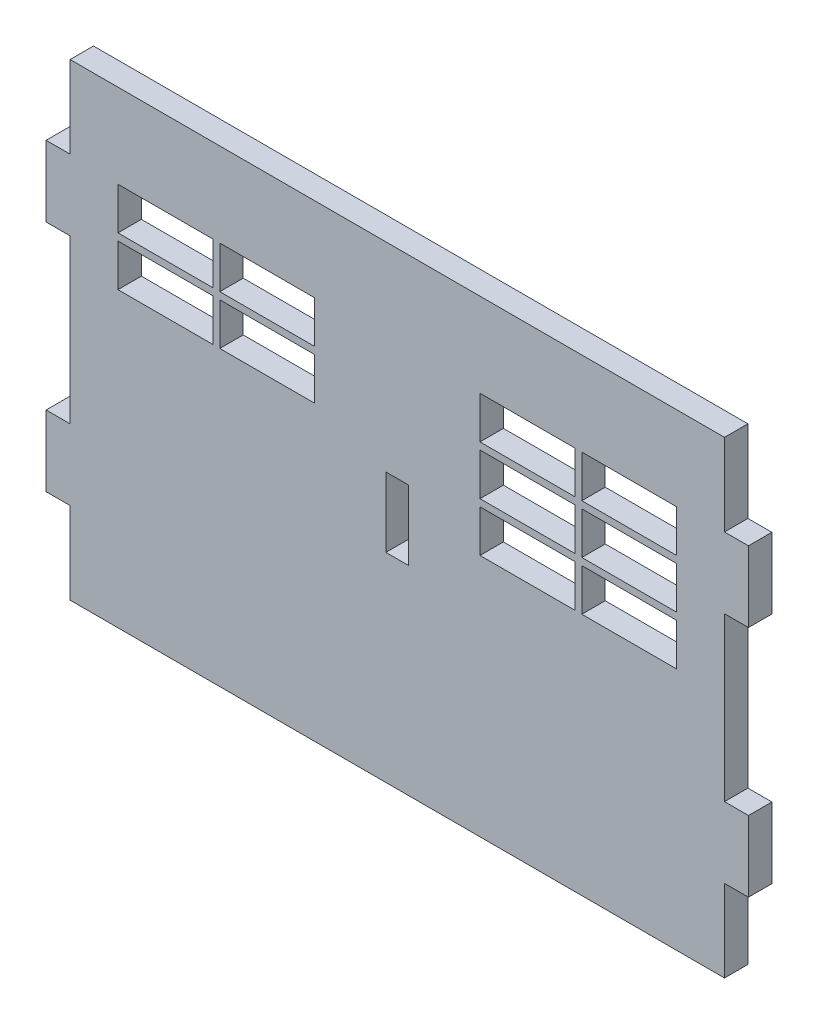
ISO-10303-21;
HEADER;
FILE_DESCRIPTION(('STEP AP214'),'2;1');
FILE_NAME('part.step','',(''),(''),'','','');
FILE_SCHEMA(('AUTOMOTIVE_DESIGN { 1 0 10303 214 1 1 1 1 }'));
ENDSEC;
DATA;
#1=APPLICATION_CONTEXT('core data for automotive mechanical design processes');
#2=APPLICATION_PROTOCOL_DEFINITION('international standard','automotive_design',2000,#1);
#3=PRODUCT_CONTEXT('',#1,'mechanical');
#4=PRODUCT('Part','Part','',(#3));
#5=PRODUCT_RELATED_PRODUCT_CATEGORY('part','',(#4));
#6=PRODUCT_DEFINITION_FORMATION('','',#4);
#7=PRODUCT_DEFINITION_CONTEXT('part definition',#1,'design');
#8=PRODUCT_DEFINITION('design','',#6,#7);
#9=PRODUCT_DEFINITION_SHAPE('','',#8);
#10=(LENGTH_UNIT() NAMED_UNIT(*) SI_UNIT(.MILLI.,.METRE.));
#11=(NAMED_UNIT(*) PLANE_ANGLE_UNIT() SI_UNIT($,.RADIAN.));
#12=(NAMED_UNIT(*) SI_UNIT($,.STERADIAN.) SOLID_ANGLE_UNIT());
#13=UNCERTAINTY_MEASURE_WITH_UNIT(LENGTH_MEASURE(1.E-05),#10,'distance_accuracy_value','');
#14=(GEOMETRIC_REPRESENTATION_CONTEXT(3) GLOBAL_UNCERTAINTY_ASSIGNED_CONTEXT((#13)) GLOBAL_UNIT_ASSIGNED_CONTEXT((#10,
#11,#12)) REPRESENTATION_CONTEXT('',''));
#15=CARTESIAN_POINT('',(0.,0.,0.));
#16=DIRECTION('',(0.,0.,1.));
#17=DIRECTION('',(1.,0.,0.));
#18=AXIS2_PLACEMENT_3D('',#15,#16,#17);
#19=CARTESIAN_POINT('',(0.,0.,10.));
#20=DIRECTION('',(0.,0.,-1.));
#21=DIRECTION('',(-1.,0.,0.));
#22=AXIS2_PLACEMENT_3D('',#19,#20,#21);
#23=PLANE('',#22);
#24=DIRECTION('',(0.,1.,0.));
#25=VECTOR('',#24,1.);
#26=CARTESIAN_POINT('',(182.362625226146,33.9625174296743,10.));
#27=LINE('',#26,#25);
#28=CARTESIAN_POINT('',(182.362625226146,15.9625174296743,10.));
#29=VERTEX_POINT('',#28);
#30=CARTESIAN_POINT('',(182.362625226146,33.9625174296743,10.));
#31=VERTEX_POINT('',#30);
#32=EDGE_CURVE('E1529',#29,#31,#27,.T.);
#33=ORIENTED_EDGE('',*,*,#32,.F.);
#34=DIRECTION('',(1.,0.,0.));
#35=VECTOR('',#34,1.);
#36=CARTESIAN_POINT('',(182.362625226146,15.9625174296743,10.));
#37=LINE('',#36,#35);
#38=CARTESIAN_POINT('',(141.862625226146,15.9625174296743,10.));
#39=VERTEX_POINT('',#38);
#40=EDGE_CURVE('E1542',#39,#29,#37,.T.);
#41=ORIENTED_EDGE('',*,*,#40,.F.);
#42=DIRECTION('',(0.,-1.,0.));
#43=VECTOR('',#42,1.);
#44=CARTESIAN_POINT('',(141.862625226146,33.9625174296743,10.));
#45=LINE('',#44,#43);
#46=CARTESIAN_POINT('',(141.862625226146,33.9625174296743,10.));
#47=VERTEX_POINT('',#46);
#48=EDGE_CURVE('E1547',#47,#39,#45,.T.);
#49=ORIENTED_EDGE('',*,*,#48,.F.);
#50=DIRECTION('',(-1.,0.,0.));
#51=VECTOR('',#50,1.);
#52=CARTESIAN_POINT('',(182.362625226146,33.9625174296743,10.));
#53=LINE('',#52,#51);
#54=EDGE_CURVE('E1533',#31,#47,#53,.T.);
#55=ORIENTED_EDGE('',*,*,#54,.F.);
#56=EDGE_LOOP('',(#33,#41,#49,#55));
#57=FACE_BOUND('',#56,.T.);
#58=DIRECTION('',(-1.,0.,0.));
#59=VECTOR('',#58,1.);
#60=CARTESIAN_POINT('',(182.362625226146,12.9625174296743,10.));
#61=LINE('',#60,#59);
#62=CARTESIAN_POINT('',(182.362625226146,12.9625174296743,10.));
#63=VERTEX_POINT('',#62);
#64=CARTESIAN_POINT('',(141.862625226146,12.9625174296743,10.));
#65=VERTEX_POINT('',#64);
#66=EDGE_CURVE('E1588',#63,#65,#61,.T.);
#67=ORIENTED_EDGE('',*,*,#66,.F.);
#68=DIRECTION('',(0.,1.,0.));
#69=VECTOR('',#68,1.);
#70=CARTESIAN_POINT('',(182.362625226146,12.9625174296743,10.));
#71=LINE('',#70,#69);
#72=CARTESIAN_POINT('',(182.362625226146,-5.03748257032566,10.));
#73=VERTEX_POINT('',#72);
#74=EDGE_CURVE('E1601',#73,#63,#71,.T.);
#75=ORIENTED_EDGE('',*,*,#74,.F.);
#76=DIRECTION('',(1.,0.,0.));
#77=VECTOR('',#76,1.);
#78=CARTESIAN_POINT('',(182.362625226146,-5.03748257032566,10.));
#79=LINE('',#78,#77);
#80=CARTESIAN_POINT('',(141.862625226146,-5.03748257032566,10.));
#81=VERTEX_POINT('',#80);
#82=EDGE_CURVE('E1606',#81,#73,#79,.T.);
#83=ORIENTED_EDGE('',*,*,#82,.F.);
#84=DIRECTION('',(0.,-1.,0.));
#85=VECTOR('',#84,1.);
#86=CARTESIAN_POINT('',(141.862625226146,12.9625174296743,10.));
#87=LINE('',#86,#85);
#88=EDGE_CURVE('E1592',#65,#81,#87,.T.);
#89=ORIENTED_EDGE('',*,*,#88,.F.);
#90=EDGE_LOOP('',(#67,#75,#83,#89));
#91=FACE_BOUND('',#90,.T.);
#92=DIRECTION('',(-1.,0.,0.));
#93=VECTOR('',#92,1.);
#94=CARTESIAN_POINT('',(98.3626252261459,-8.03748257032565,10.));
#95=LINE('',#94,#93);
#96=CARTESIAN_POINT('',(138.862625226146,-8.03748257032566,10.));
#97=VERTEX_POINT('',#96);
#98=CARTESIAN_POINT('',(98.3626252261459,-8.03748257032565,10.));
#99=VERTEX_POINT('',#98);
#100=EDGE_CURVE('E1647',#97,#99,#95,.T.);
#101=ORIENTED_EDGE('',*,*,#100,.F.);
#102=DIRECTION('',(0.,1.,0.));
#103=VECTOR('',#102,1.);
#104=CARTESIAN_POINT('',(138.862625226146,-8.03748257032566,10.));
#105=LINE('',#104,#103);
#106=CARTESIAN_POINT('',(138.862625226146,-26.0374825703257,10.));
#107=VERTEX_POINT('',#106);
#108=EDGE_CURVE('E1660',#107,#97,#105,.T.);
#109=ORIENTED_EDGE('',*,*,#108,.F.);
#110=DIRECTION('',(1.,0.,0.));
#111=VECTOR('',#110,1.);
#112=CARTESIAN_POINT('',(138.862625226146,-26.0374825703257,10.));
#113=LINE('',#112,#111);
#114=CARTESIAN_POINT('',(98.3626252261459,-26.0374825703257,10.));
#115=VERTEX_POINT('',#114);
#116=EDGE_CURVE('E1665',#115,#107,#113,.T.);
#117=ORIENTED_EDGE('',*,*,#116,.F.);
#118=DIRECTION('',(0.,-1.,0.));
#119=VECTOR('',#118,1.);
#120=CARTESIAN_POINT('',(98.3626252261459,-8.03748257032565,10.));
#121=LINE('',#120,#119);
#122=EDGE_CURVE('E1651',#99,#115,#121,.T.);
#123=ORIENTED_EDGE('',*,*,#122,.F.);
#124=EDGE_LOOP('',(#101,#109,#117,#123));
#125=FACE_BOUND('',#124,.T.);
#126=DIRECTION('',(-1.,0.,0.));
#127=VECTOR('',#126,1.);
#128=CARTESIAN_POINT('',(27.7243312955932,12.9625174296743,10.));
#129=LINE('',#128,#127);
#130=CARTESIAN_POINT('',(27.7243312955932,12.9625174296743,10.));
#131=VERTEX_POINT('',#130);
#132=CARTESIAN_POINT('',(-12.7756687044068,12.9625174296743,10.));
#133=VERTEX_POINT('',#132);
#134=EDGE_CURVE('E1706',#131,#133,#129,.T.);
#135=ORIENTED_EDGE('',*,*,#134,.F.);
#136=DIRECTION('',(0.,1.,0.));
#137=VECTOR('',#136,1.);
#138=CARTESIAN_POINT('',(27.7243312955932,12.9625174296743,10.));
#139=LINE('',#138,#137);
#140=CARTESIAN_POINT('',(27.7243312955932,-5.03748257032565,10.));
#141=VERTEX_POINT('',#140);
#142=EDGE_CURVE('E1719',#141,#131,#139,.T.);
#143=ORIENTED_EDGE('',*,*,#142,.F.);
#144=DIRECTION('',(1.,0.,0.));
#145=VECTOR('',#144,1.);
#146=CARTESIAN_POINT('',(27.7243312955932,-5.03748257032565,10.));
#147=LINE('',#146,#145);
#148=CARTESIAN_POINT('',(-12.7756687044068,-5.03748257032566,10.));
#149=VERTEX_POINT('',#148);
#150=EDGE_CURVE('E1724',#149,#141,#147,.T.);
#151=ORIENTED_EDGE('',*,*,#150,.F.);
#152=DIRECTION('',(0.,-1.,0.));
#153=VECTOR('',#152,1.);
#154=CARTESIAN_POINT('',(-12.7756687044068,12.9625174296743,10.));
#155=LINE('',#154,#153);
#156=EDGE_CURVE('E1710',#133,#149,#155,.T.);
#157=ORIENTED_EDGE('',*,*,#156,.F.);
#158=EDGE_LOOP('',(#135,#143,#151,#157));
#159=FACE_BOUND('',#158,.T.);
#160=DIRECTION('',(-1.,0.,0.));
#161=VECTOR('',#160,1.);
#162=CARTESIAN_POINT('',(-12.7756687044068,33.9625174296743,10.));
#163=LINE('',#162,#161);
#164=CARTESIAN_POINT('',(27.7243312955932,33.9625174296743,10.));
#165=VERTEX_POINT('',#164);
#166=CARTESIAN_POINT('',(-12.7756687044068,33.9625174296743,10.));
#167=VERTEX_POINT('',#166);
#168=EDGE_CURVE('E1765',#165,#167,#163,.T.);
#169=ORIENTED_EDGE('',*,*,#168,.F.);
#170=DIRECTION('',(0.,1.,0.));
#171=VECTOR('',#170,1.);
#172=CARTESIAN_POINT('',(27.7243312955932,33.9625174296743,10.));
#173=LINE('',#172,#171);
#174=CARTESIAN_POINT('',(27.7243312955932,15.9625174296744,10.));
#175=VERTEX_POINT('',#174);
#176=EDGE_CURVE('E1775',#175,#165,#173,.T.);
#177=ORIENTED_EDGE('',*,*,#176,.F.);
#178=DIRECTION('',(1.,0.,0.));
#179=VECTOR('',#178,1.);
#180=CARTESIAN_POINT('',(27.7243312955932,15.9625174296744,10.));
#181=LINE('',#180,#179);
#182=CARTESIAN_POINT('',(-12.7756687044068,15.9625174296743,10.));
#183=VERTEX_POINT('',#182);
#184=EDGE_CURVE('E1780',#183,#175,#181,.T.);
#185=ORIENTED_EDGE('',*,*,#184,.F.);
#186=DIRECTION('',(0.,-1.,0.));
#187=VECTOR('',#186,1.);
#188=CARTESIAN_POINT('',(-12.7756687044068,33.9625174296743,10.));
#189=LINE('',#188,#187);
#190=EDGE_CURVE('E1768',#167,#183,#189,.T.);
#191=ORIENTED_EDGE('',*,*,#190,.F.);
#192=EDGE_LOOP('',(#169,#177,#185,#191));
#193=FACE_BOUND('',#192,.T.);
#194=DIRECTION('',(0.,-1.,0.));
#195=VECTOR('',#194,1.);
#196=CARTESIAN_POINT('',(-76.7165217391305,69.8757763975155,10.));
#197=LINE('',#196,#195);
#198=CARTESIAN_POINT('',(-76.7165217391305,69.8757763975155,10.));
#199=VERTEX_POINT('',#198);
#200=CARTESIAN_POINT('',(-76.7165217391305,34.8757763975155,10.));
#201=VERTEX_POINT('',#200);
#202=EDGE_CURVE('E654',#199,#201,#197,.T.);
#203=ORIENTED_EDGE('',*,*,#202,.T.);
#204=DIRECTION('',(-1.,0.,0.));
#205=VECTOR('',#204,1.);
#206=CARTESIAN_POINT('',(-76.7165217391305,34.8757763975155,10.));
#207=LINE('',#206,#205);
#208=CARTESIAN_POINT('',(-86.9565217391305,34.8757763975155,10.));
#209=VERTEX_POINT('',#208);
#210=EDGE_CURVE('E825',#201,#209,#207,.T.);
#211=ORIENTED_EDGE('',*,*,#210,.T.);
#212=DIRECTION('',(0.,-1.,0.));
#213=VECTOR('',#212,1.);
#214=CARTESIAN_POINT('',(-86.9565217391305,34.8757763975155,10.));
#215=LINE('',#214,#213);
#216=CARTESIAN_POINT('',(-86.9565217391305,4.63577639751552,10.));
#217=VERTEX_POINT('',#216);
#218=EDGE_CURVE('E714',#209,#217,#215,.T.);
#219=ORIENTED_EDGE('',*,*,#218,.T.);
#220=DIRECTION('',(1.,0.,0.));
#221=VECTOR('',#220,1.);
#222=CARTESIAN_POINT('',(-76.7165217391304,4.63577639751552,10.));
#223=LINE('',#222,#221);
#224=CARTESIAN_POINT('',(-76.7165217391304,4.63577639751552,10.));
#225=VERTEX_POINT('',#224);
#226=EDGE_CURVE('E736',#217,#225,#223,.T.);
#227=ORIENTED_EDGE('',*,*,#226,.T.);
#228=DIRECTION('',(0.,-1.,0.));
#229=VECTOR('',#228,1.);
#230=CARTESIAN_POINT('',(-76.7165217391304,4.63577639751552,10.));
#231=LINE('',#230,#229);
#232=CARTESIAN_POINT('',(-76.7165217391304,-64.8842236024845,10.));
#233=VERTEX_POINT('',#232);
#234=EDGE_CURVE('E731',#225,#233,#231,.T.);
#235=ORIENTED_EDGE('',*,*,#234,.T.);
#236=DIRECTION('',(-1.,0.,0.));
#237=VECTOR('',#236,1.);
#238=CARTESIAN_POINT('',(-76.7165217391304,-64.8842236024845,10.));
#239=LINE('',#238,#237);
#240=CARTESIAN_POINT('',(-86.9565217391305,-64.8842236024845,10.));
#241=VERTEX_POINT('',#240);
#242=EDGE_CURVE('E735',#233,#241,#239,.T.);
#243=ORIENTED_EDGE('',*,*,#242,.T.);
#244=DIRECTION('',(0.,-1.,0.));
#245=VECTOR('',#244,1.);
#246=CARTESIAN_POINT('',(-86.9565217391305,-95.1242236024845,10.));
#247=LINE('',#246,#245);
#248=CARTESIAN_POINT('',(-86.9565217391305,-95.1242236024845,10.));
#249=VERTEX_POINT('',#248);
#250=EDGE_CURVE('E740',#241,#249,#247,.T.);
#251=ORIENTED_EDGE('',*,*,#250,.T.);
#252=DIRECTION('',(1.,0.,0.));
#253=VECTOR('',#252,1.);
#254=CARTESIAN_POINT('',(-76.7165217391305,-95.1242236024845,10.));
#255=LINE('',#254,#253);
#256=CARTESIAN_POINT('',(-76.7165217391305,-95.1242236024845,10.));
#257=VERTEX_POINT('',#256);
#258=EDGE_CURVE('E758',#249,#257,#255,.T.);
#259=ORIENTED_EDGE('',*,*,#258,.T.);
#260=DIRECTION('',(0.,-1.,0.));
#261=VECTOR('',#260,1.);
#262=CARTESIAN_POINT('',(-76.7165217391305,-95.1242236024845,10.));
#263=LINE('',#262,#261);
#264=CARTESIAN_POINT('',(-76.7165217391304,-130.124223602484,10.));
#265=VERTEX_POINT('',#264);
#266=EDGE_CURVE('E762',#257,#265,#263,.T.);
#267=ORIENTED_EDGE('',*,*,#266,.T.);
#268=DIRECTION('',(1.,0.,0.));
#269=VECTOR('',#268,1.);
#270=CARTESIAN_POINT('',(-76.7165217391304,-130.124223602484,10.));
#271=LINE('',#270,#269);
#272=CARTESIAN_POINT('',(202.80347826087,-130.124223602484,10.));
#273=VERTEX_POINT('',#272);
#274=EDGE_CURVE('E766',#265,#273,#271,.T.);
#275=ORIENTED_EDGE('',*,*,#274,.T.);
#276=DIRECTION('',(0.,1.,0.));
#277=VECTOR('',#276,1.);
#278=CARTESIAN_POINT('',(202.80347826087,-95.1242236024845,10.));
#279=LINE('',#278,#277);
#280=CARTESIAN_POINT('',(202.80347826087,-95.1242236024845,10.));
#281=VERTEX_POINT('',#280);
#282=EDGE_CURVE('E774',#273,#281,#279,.T.);
#283=ORIENTED_EDGE('',*,*,#282,.T.);
#284=DIRECTION('',(1.,0.,0.));
#285=VECTOR('',#284,1.);
#286=CARTESIAN_POINT('',(202.80347826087,-95.1242236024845,10.));
#287=LINE('',#286,#285);
#288=CARTESIAN_POINT('',(213.04347826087,-95.1242236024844,10.));
#289=VERTEX_POINT('',#288);
#290=EDGE_CURVE('E777',#281,#289,#287,.T.);
#291=ORIENTED_EDGE('',*,*,#290,.T.);
#292=DIRECTION('',(0.,1.,0.));
#293=VECTOR('',#292,1.);
#294=CARTESIAN_POINT('',(213.04347826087,-95.1242236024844,10.));
#295=LINE('',#294,#293);
#296=CARTESIAN_POINT('',(213.04347826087,-64.8842236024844,10.));
#297=VERTEX_POINT('',#296);
#298=EDGE_CURVE('E781',#289,#297,#295,.T.);
#299=ORIENTED_EDGE('',*,*,#298,.T.);
#300=DIRECTION('',(-1.,0.,0.));
#301=VECTOR('',#300,1.);
#302=CARTESIAN_POINT('',(202.803478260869,-64.8842236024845,10.));
#303=LINE('',#302,#301);
#304=CARTESIAN_POINT('',(202.803478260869,-64.8842236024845,10.));
#305=VERTEX_POINT('',#304);
#306=EDGE_CURVE('E785',#297,#305,#303,.T.);
#307=ORIENTED_EDGE('',*,*,#306,.T.);
#308=DIRECTION('',(0.,1.,0.));
#309=VECTOR('',#308,1.);
#310=CARTESIAN_POINT('',(202.803478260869,4.63577639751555,10.));
#311=LINE('',#310,#309);
#312=CARTESIAN_POINT('',(202.803478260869,4.63577639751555,10.));
#313=VERTEX_POINT('',#312);
#314=EDGE_CURVE('E793',#305,#313,#311,.T.);
#315=ORIENTED_EDGE('',*,*,#314,.T.);
#316=DIRECTION('',(1.,0.,0.));
#317=VECTOR('',#316,1.);
#318=CARTESIAN_POINT('',(202.803478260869,4.63577639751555,10.));
#319=LINE('',#318,#317);
#320=CARTESIAN_POINT('',(213.04347826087,4.63577639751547,10.));
#321=VERTEX_POINT('',#320);
#322=EDGE_CURVE('E796',#313,#321,#319,.T.);
#323=ORIENTED_EDGE('',*,*,#322,.T.);
#324=DIRECTION('',(0.,1.,0.));
#325=VECTOR('',#324,1.);
#326=CARTESIAN_POINT('',(213.04347826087,34.8757763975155,10.));
#327=LINE('',#326,#325);
#328=CARTESIAN_POINT('',(213.04347826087,34.8757763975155,10.));
#329=VERTEX_POINT('',#328);
#330=EDGE_CURVE('E800',#321,#329,#327,.T.);
#331=ORIENTED_EDGE('',*,*,#330,.T.);
#332=DIRECTION('',(-1.,0.,0.));
#333=VECTOR('',#332,1.);
#334=CARTESIAN_POINT('',(202.80347826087,34.8757763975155,10.));
#335=LINE('',#334,#333);
#336=CARTESIAN_POINT('',(202.80347826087,34.8757763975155,10.));
#337=VERTEX_POINT('',#336);
#338=EDGE_CURVE('E803',#329,#337,#335,.T.);
#339=ORIENTED_EDGE('',*,*,#338,.T.);
#340=DIRECTION('',(0.,1.,0.));
#341=VECTOR('',#340,1.);
#342=CARTESIAN_POINT('',(202.80347826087,69.8757763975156,10.));
#343=LINE('',#342,#341);
#344=CARTESIAN_POINT('',(202.80347826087,69.8757763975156,10.));
#345=VERTEX_POINT('',#344);
#346=EDGE_CURVE('E609',#337,#345,#343,.T.);
#347=ORIENTED_EDGE('',*,*,#346,.T.);
#348=DIRECTION('',(-1.,0.,0.));
#349=VECTOR('',#348,1.);
#350=CARTESIAN_POINT('',(-76.7165217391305,69.8757763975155,10.));
#351=LINE('',#350,#349);
#352=EDGE_CURVE('E604',#345,#199,#351,.T.);
#353=ORIENTED_EDGE('',*,*,#352,.T.);
#354=EDGE_LOOP('',(#203,#211,#219,#227,#235,#243,#251,#259,#267,#275,#283,#291,#299,#307,#315,
#323,#331,#339,#347,#353));
#355=FACE_BOUND('',#354,.T.);
#356=DIRECTION('',(0.,-1.,0.));
#357=VECTOR('',#356,1.);
#358=CARTESIAN_POINT('',(-56.2756687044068,33.9625174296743,10.));
#359=LINE('',#358,#357);
#360=CARTESIAN_POINT('',(-56.2756687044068,33.9625174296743,10.));
#361=VERTEX_POINT('',#360);
#362=CARTESIAN_POINT('',(-56.2756687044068,15.9625174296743,10.));
#363=VERTEX_POINT('',#362);
#364=EDGE_CURVE('E584',#361,#363,#359,.T.);
#365=ORIENTED_EDGE('',*,*,#364,.F.);
#366=DIRECTION('',(-1.,0.,0.));
#367=VECTOR('',#366,1.);
#368=CARTESIAN_POINT('',(-56.2756687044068,33.9625174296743,10.));
#369=LINE('',#368,#367);
#370=CARTESIAN_POINT('',(-15.7756687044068,33.9625174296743,10.));
#371=VERTEX_POINT('',#370);
#372=EDGE_CURVE('E591',#371,#361,#369,.T.);
#373=ORIENTED_EDGE('',*,*,#372,.F.);
#374=DIRECTION('',(0.,1.,0.));
#375=VECTOR('',#374,1.);
#376=CARTESIAN_POINT('',(-15.7756687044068,33.9625174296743,10.));
#377=LINE('',#376,#375);
#378=CARTESIAN_POINT('',(-15.7756687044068,15.9625174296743,10.));
#379=VERTEX_POINT('',#378);
#380=EDGE_CURVE('E583',#379,#371,#377,.T.);
#381=ORIENTED_EDGE('',*,*,#380,.F.);
#382=DIRECTION('',(1.,0.,0.));
#383=VECTOR('',#382,1.);
#384=CARTESIAN_POINT('',(-56.2756687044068,15.9625174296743,10.));
#385=LINE('',#384,#383);
#386=EDGE_CURVE('E579',#363,#379,#385,.T.);
#387=ORIENTED_EDGE('',*,*,#386,.F.);
#388=EDGE_LOOP('',(#365,#373,#381,#387));
#389=FACE_BOUND('',#388,.T.);
#390=DIRECTION('',(0.,-1.,0.));
#391=VECTOR('',#390,1.);
#392=CARTESIAN_POINT('',(-56.2756687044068,12.9625174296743,10.));
#393=LINE('',#392,#391);
#394=CARTESIAN_POINT('',(-56.2756687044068,12.9625174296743,10.));
#395=VERTEX_POINT('',#394);
#396=CARTESIAN_POINT('',(-56.2756687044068,-5.03748257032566,10.));
#397=VERTEX_POINT('',#396);
#398=EDGE_CURVE('E559',#395,#397,#393,.T.);
#399=ORIENTED_EDGE('',*,*,#398,.F.);
#400=DIRECTION('',(-1.,0.,0.));
#401=VECTOR('',#400,1.);
#402=CARTESIAN_POINT('',(-56.2756687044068,12.9625174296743,10.));
#403=LINE('',#402,#401);
#404=CARTESIAN_POINT('',(-15.7756687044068,12.9625174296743,10.));
#405=VERTEX_POINT('',#404);
#406=EDGE_CURVE('E566',#405,#395,#403,.T.);
#407=ORIENTED_EDGE('',*,*,#406,.F.);
#408=DIRECTION('',(0.,1.,0.));
#409=VECTOR('',#408,1.);
#410=CARTESIAN_POINT('',(-15.7756687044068,12.9625174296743,10.));
#411=LINE('',#410,#409);
#412=CARTESIAN_POINT('',(-15.7756687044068,-5.03748257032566,10.));
#413=VERTEX_POINT('',#412);
#414=EDGE_CURVE('E558',#413,#405,#411,.T.);
#415=ORIENTED_EDGE('',*,*,#414,.F.);
#416=DIRECTION('',(1.,0.,0.));
#417=VECTOR('',#416,1.);
#418=CARTESIAN_POINT('',(-56.2756687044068,-5.03748257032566,10.));
#419=LINE('',#418,#417);
#420=EDGE_CURVE('E554',#397,#413,#419,.T.);
#421=ORIENTED_EDGE('',*,*,#420,.F.);
#422=EDGE_LOOP('',(#399,#407,#415,#421));
#423=FACE_BOUND('',#422,.T.);
#424=DIRECTION('',(-1.,0.,0.));
#425=VECTOR('',#424,1.);
#426=CARTESIAN_POINT('',(98.3626252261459,12.9625174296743,10.));
#427=LINE('',#426,#425);
#428=CARTESIAN_POINT('',(138.862625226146,12.9625174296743,10.));
#429=VERTEX_POINT('',#428);
#430=CARTESIAN_POINT('',(98.3626252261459,12.9625174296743,10.));
#431=VERTEX_POINT('',#430);
#432=EDGE_CURVE('E534',#429,#431,#427,.T.);
#433=ORIENTED_EDGE('',*,*,#432,.F.);
#434=DIRECTION('',(0.,1.,0.));
#435=VECTOR('',#434,1.);
#436=CARTESIAN_POINT('',(138.862625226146,12.9625174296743,10.));
#437=LINE('',#436,#435);
#438=CARTESIAN_POINT('',(138.862625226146,-5.03748257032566,10.));
#439=VERTEX_POINT('',#438);
#440=EDGE_CURVE('E541',#439,#429,#437,.T.);
#441=ORIENTED_EDGE('',*,*,#440,.F.);
#442=DIRECTION('',(1.,0.,0.));
#443=VECTOR('',#442,1.);
#444=CARTESIAN_POINT('',(98.3626252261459,-5.03748257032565,10.));
#445=LINE('',#444,#443);
#446=CARTESIAN_POINT('',(98.3626252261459,-5.03748257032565,10.));
#447=VERTEX_POINT('',#446);
#448=EDGE_CURVE('E533',#447,#439,#445,.T.);
#449=ORIENTED_EDGE('',*,*,#448,.F.);
#450=DIRECTION('',(0.,-1.,0.));
#451=VECTOR('',#450,1.);
#452=CARTESIAN_POINT('',(98.3626252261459,12.9625174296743,10.));
#453=LINE('',#452,#451);
#454=EDGE_CURVE('E529',#431,#447,#453,.T.);
#455=ORIENTED_EDGE('',*,*,#454,.F.);
#456=EDGE_LOOP('',(#433,#441,#449,#455));
#457=FACE_BOUND('',#456,.T.);
#458=DIRECTION('',(0.,-1.,0.));
#459=VECTOR('',#458,1.);
#460=CARTESIAN_POINT('',(98.3626252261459,33.9625174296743,10.));
#461=LINE('',#460,#459);
#462=CARTESIAN_POINT('',(98.3626252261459,33.9625174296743,10.));
#463=VERTEX_POINT('',#462);
#464=CARTESIAN_POINT('',(98.3626252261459,15.9625174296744,10.));
#465=VERTEX_POINT('',#464);
#466=EDGE_CURVE('E509',#463,#465,#461,.T.);
#467=ORIENTED_EDGE('',*,*,#466,.F.);
#468=DIRECTION('',(-1.,0.,0.));
#469=VECTOR('',#468,1.);
#470=CARTESIAN_POINT('',(138.862625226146,33.9625174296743,10.));
#471=LINE('',#470,#469);
#472=CARTESIAN_POINT('',(138.862625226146,33.9625174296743,10.));
#473=VERTEX_POINT('',#472);
#474=EDGE_CURVE('E516',#473,#463,#471,.T.);
#475=ORIENTED_EDGE('',*,*,#474,.F.);
#476=DIRECTION('',(0.,1.,0.));
#477=VECTOR('',#476,1.);
#478=CARTESIAN_POINT('',(138.862625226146,33.9625174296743,10.));
#479=LINE('',#478,#477);
#480=CARTESIAN_POINT('',(138.862625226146,15.9625174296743,10.));
#481=VERTEX_POINT('',#480);
#482=EDGE_CURVE('E508',#481,#473,#479,.T.);
#483=ORIENTED_EDGE('',*,*,#482,.F.);
#484=DIRECTION('',(1.,0.,0.));
#485=VECTOR('',#484,1.);
#486=CARTESIAN_POINT('',(98.3626252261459,15.9625174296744,10.));
#487=LINE('',#486,#485);
#488=EDGE_CURVE('E504',#465,#481,#487,.T.);
#489=ORIENTED_EDGE('',*,*,#488,.F.);
#490=EDGE_LOOP('',(#467,#475,#483,#489));
#491=FACE_BOUND('',#490,.T.);
#492=DIRECTION('',(-1.,0.,0.));
#493=VECTOR('',#492,1.);
#494=CARTESIAN_POINT('',(182.362625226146,-8.03748257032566,10.));
#495=LINE('',#494,#493);
#496=CARTESIAN_POINT('',(182.362625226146,-8.03748257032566,10.));
#497=VERTEX_POINT('',#496);
#498=CARTESIAN_POINT('',(141.862625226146,-8.03748257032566,10.));
#499=VERTEX_POINT('',#498);
#500=EDGE_CURVE('E484',#497,#499,#495,.T.);
#501=ORIENTED_EDGE('',*,*,#500,.F.);
#502=DIRECTION('',(0.,1.,0.));
#503=VECTOR('',#502,1.);
#504=CARTESIAN_POINT('',(182.362625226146,-8.03748257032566,10.));
#505=LINE('',#504,#503);
#506=CARTESIAN_POINT('',(182.362625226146,-26.0374825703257,10.));
#507=VERTEX_POINT('',#506);
#508=EDGE_CURVE('E491',#507,#497,#505,.T.);
#509=ORIENTED_EDGE('',*,*,#508,.F.);
#510=DIRECTION('',(1.,0.,0.));
#511=VECTOR('',#510,1.);
#512=CARTESIAN_POINT('',(182.362625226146,-26.0374825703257,10.));
#513=LINE('',#512,#511);
#514=CARTESIAN_POINT('',(141.862625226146,-26.0374825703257,10.));
#515=VERTEX_POINT('',#514);
#516=EDGE_CURVE('E483',#515,#507,#513,.T.);
#517=ORIENTED_EDGE('',*,*,#516,.F.);
#518=DIRECTION('',(0.,-1.,0.));
#519=VECTOR('',#518,1.);
#520=CARTESIAN_POINT('',(141.862625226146,-8.03748257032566,10.));
#521=LINE('',#520,#519);
#522=EDGE_CURVE('E479',#499,#515,#521,.T.);
#523=ORIENTED_EDGE('',*,*,#522,.F.);
#524=EDGE_LOOP('',(#501,#509,#517,#523));
#525=FACE_BOUND('',#524,.T.);
#526=DIRECTION('',(0.,1.,0.));
#527=VECTOR('',#526,1.);
#528=CARTESIAN_POINT('',(67.9234782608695,-45.0042236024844,10.));
#529=LINE('',#528,#527);
#530=CARTESIAN_POINT('',(67.9234782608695,-45.0042236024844,10.));
#531=VERTEX_POINT('',#530);
#532=CARTESIAN_POINT('',(67.9234782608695,-15.2442236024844,10.));
#533=VERTEX_POINT('',#532);
#534=EDGE_CURVE('E440',#531,#533,#529,.T.);
#535=ORIENTED_EDGE('',*,*,#534,.F.);
#536=DIRECTION('',(1.,0.,0.));
#537=VECTOR('',#536,1.);
#538=CARTESIAN_POINT('',(58.1634782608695,-45.0042236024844,10.));
#539=LINE('',#538,#537);
#540=CARTESIAN_POINT('',(58.1634782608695,-45.0042236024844,10.));
#541=VERTEX_POINT('',#540);
#542=EDGE_CURVE('E464',#541,#531,#539,.T.);
#543=ORIENTED_EDGE('',*,*,#542,.F.);
#544=DIRECTION('',(0.,-1.,0.));
#545=VECTOR('',#544,1.);
#546=CARTESIAN_POINT('',(58.1634782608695,-45.0042236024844,10.));
#547=LINE('',#546,#545);
#548=CARTESIAN_POINT('',(58.1634782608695,-15.2442236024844,10.));
#549=VERTEX_POINT('',#548);
#550=EDGE_CURVE('E461',#549,#541,#547,.T.);
#551=ORIENTED_EDGE('',*,*,#550,.F.);
#552=DIRECTION('',(-1.,0.,0.));
#553=VECTOR('',#552,1.);
#554=CARTESIAN_POINT('',(58.1634782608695,-15.2442236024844,10.));
#555=LINE('',#554,#553);
#556=EDGE_CURVE('E449',#533,#549,#555,.T.);
#557=ORIENTED_EDGE('',*,*,#556,.F.);
#558=EDGE_LOOP('',(#535,#543,#551,#557));
#559=FACE_BOUND('',#558,.T.);
#560=ADVANCED_FACE('F39',(#57,#91,#125,#159,#193,#355,#389,#423,#457,#491,#525,#559),#23,.F.);
#561=CARTESIAN_POINT('',(0.,0.,0.));
#562=DIRECTION('',(0.,0.,-1.));
#563=DIRECTION('',(-1.,0.,0.));
#564=AXIS2_PLACEMENT_3D('',#561,#562,#563);
#565=PLANE('',#564);
#566=DIRECTION('',(0.,-1.,0.));
#567=VECTOR('',#566,1.);
#568=CARTESIAN_POINT('',(-76.7165217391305,69.8757763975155,0.));
#569=LINE('',#568,#567);
#570=CARTESIAN_POINT('',(-76.7165217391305,69.8757763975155,0.));
#571=VERTEX_POINT('',#570);
#572=CARTESIAN_POINT('',(-76.7165217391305,34.8757763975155,0.));
#573=VERTEX_POINT('',#572);
#574=EDGE_CURVE('E612',#571,#573,#569,.T.);
#575=ORIENTED_EDGE('',*,*,#574,.F.);
#576=DIRECTION('',(-1.,0.,0.));
#577=VECTOR('',#576,1.);
#578=CARTESIAN_POINT('',(-76.7165217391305,69.8757763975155,0.));
#579=LINE('',#578,#577);
#580=CARTESIAN_POINT('',(202.80347826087,69.8757763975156,0.));
#581=VERTEX_POINT('',#580);
#582=EDGE_CURVE('E652',#581,#571,#579,.T.);
#583=ORIENTED_EDGE('',*,*,#582,.F.);
#584=DIRECTION('',(0.,1.,0.));
#585=VECTOR('',#584,1.);
#586=CARTESIAN_POINT('',(202.80347826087,69.8757763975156,0.));
#587=LINE('',#586,#585);
#588=CARTESIAN_POINT('',(202.80347826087,34.8757763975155,0.));
#589=VERTEX_POINT('',#588);
#590=EDGE_CURVE('E650',#589,#581,#587,.T.);
#591=ORIENTED_EDGE('',*,*,#590,.F.);
#592=DIRECTION('',(-1.,0.,0.));
#593=VECTOR('',#592,1.);
#594=CARTESIAN_POINT('',(202.80347826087,34.8757763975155,0.));
#595=LINE('',#594,#593);
#596=CARTESIAN_POINT('',(213.04347826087,34.8757763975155,0.));
#597=VERTEX_POINT('',#596);
#598=EDGE_CURVE('E648',#597,#589,#595,.T.);
#599=ORIENTED_EDGE('',*,*,#598,.F.);
#600=DIRECTION('',(0.,1.,0.));
#601=VECTOR('',#600,1.);
#602=CARTESIAN_POINT('',(213.04347826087,34.8757763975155,0.));
#603=LINE('',#602,#601);
#604=CARTESIAN_POINT('',(213.04347826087,4.63577639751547,0.));
#605=VERTEX_POINT('',#604);
#606=EDGE_CURVE('E646',#605,#597,#603,.T.);
#607=ORIENTED_EDGE('',*,*,#606,.F.);
#608=DIRECTION('',(1.,0.,0.));
#609=VECTOR('',#608,1.);
#610=CARTESIAN_POINT('',(202.803478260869,4.63577639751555,0.));
#611=LINE('',#610,#609);
#612=CARTESIAN_POINT('',(202.803478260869,4.63577639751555,0.));
#613=VERTEX_POINT('',#612);
#614=EDGE_CURVE('E644',#613,#605,#611,.T.);
#615=ORIENTED_EDGE('',*,*,#614,.F.);
#616=DIRECTION('',(0.,1.,0.));
#617=VECTOR('',#616,1.);
#618=CARTESIAN_POINT('',(202.803478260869,4.63577639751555,0.));
#619=LINE('',#618,#617);
#620=CARTESIAN_POINT('',(202.803478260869,-64.8842236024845,0.));
#621=VERTEX_POINT('',#620);
#622=EDGE_CURVE('E642',#621,#613,#619,.T.);
#623=ORIENTED_EDGE('',*,*,#622,.F.);
#624=DIRECTION('',(-1.,0.,0.));
#625=VECTOR('',#624,1.);
#626=CARTESIAN_POINT('',(202.803478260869,-64.8842236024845,0.));
#627=LINE('',#626,#625);
#628=CARTESIAN_POINT('',(213.04347826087,-64.8842236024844,0.));
#629=VERTEX_POINT('',#628);
#630=EDGE_CURVE('E640',#629,#621,#627,.T.);
#631=ORIENTED_EDGE('',*,*,#630,.F.);
#632=DIRECTION('',(0.,1.,0.));
#633=VECTOR('',#632,1.);
#634=CARTESIAN_POINT('',(213.04347826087,-95.1242236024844,0.));
#635=LINE('',#634,#633);
#636=CARTESIAN_POINT('',(213.04347826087,-95.1242236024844,0.));
#637=VERTEX_POINT('',#636);
#638=EDGE_CURVE('E638',#637,#629,#635,.T.);
#639=ORIENTED_EDGE('',*,*,#638,.F.);
#640=DIRECTION('',(1.,0.,0.));
#641=VECTOR('',#640,1.);
#642=CARTESIAN_POINT('',(202.80347826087,-95.1242236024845,0.));
#643=LINE('',#642,#641);
#644=CARTESIAN_POINT('',(202.80347826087,-95.1242236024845,0.));
#645=VERTEX_POINT('',#644);
#646=EDGE_CURVE('E636',#645,#637,#643,.T.);
#647=ORIENTED_EDGE('',*,*,#646,.F.);
#648=DIRECTION('',(0.,1.,0.));
#649=VECTOR('',#648,1.);
#650=CARTESIAN_POINT('',(202.80347826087,-95.1242236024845,0.));
#651=LINE('',#650,#649);
#652=CARTESIAN_POINT('',(202.80347826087,-130.124223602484,0.));
#653=VERTEX_POINT('',#652);
#654=EDGE_CURVE('E634',#653,#645,#651,.T.);
#655=ORIENTED_EDGE('',*,*,#654,.F.);
#656=DIRECTION('',(1.,0.,0.));
#657=VECTOR('',#656,1.);
#658=CARTESIAN_POINT('',(-76.7165217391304,-130.124223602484,0.));
#659=LINE('',#658,#657);
#660=CARTESIAN_POINT('',(-76.7165217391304,-130.124223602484,0.));
#661=VERTEX_POINT('',#660);
#662=EDGE_CURVE('E632',#661,#653,#659,.T.);
#663=ORIENTED_EDGE('',*,*,#662,.F.);
#664=DIRECTION('',(0.,-1.,0.));
#665=VECTOR('',#664,1.);
#666=CARTESIAN_POINT('',(-76.7165217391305,-95.1242236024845,0.));
#667=LINE('',#666,#665);
#668=CARTESIAN_POINT('',(-76.7165217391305,-95.1242236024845,0.));
#669=VERTEX_POINT('',#668);
#670=EDGE_CURVE('E630',#669,#661,#667,.T.);
#671=ORIENTED_EDGE('',*,*,#670,.F.);
#672=DIRECTION('',(1.,0.,0.));
#673=VECTOR('',#672,1.);
#674=CARTESIAN_POINT('',(-76.7165217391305,-95.1242236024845,0.));
#675=LINE('',#674,#673);
#676=CARTESIAN_POINT('',(-86.9565217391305,-95.1242236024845,0.));
#677=VERTEX_POINT('',#676);
#678=EDGE_CURVE('E628',#677,#669,#675,.T.);
#679=ORIENTED_EDGE('',*,*,#678,.F.);
#680=DIRECTION('',(0.,-1.,0.));
#681=VECTOR('',#680,1.);
#682=CARTESIAN_POINT('',(-86.9565217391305,-95.1242236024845,0.));
#683=LINE('',#682,#681);
#684=CARTESIAN_POINT('',(-86.9565217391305,-64.8842236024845,0.));
#685=VERTEX_POINT('',#684);
#686=EDGE_CURVE('E626',#685,#677,#683,.T.);
#687=ORIENTED_EDGE('',*,*,#686,.F.);
#688=DIRECTION('',(-1.,0.,0.));
#689=VECTOR('',#688,1.);
#690=CARTESIAN_POINT('',(-76.7165217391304,-64.8842236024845,0.));
#691=LINE('',#690,#689);
#692=CARTESIAN_POINT('',(-76.7165217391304,-64.8842236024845,0.));
#693=VERTEX_POINT('',#692);
#694=EDGE_CURVE('E624',#693,#685,#691,.T.);
#695=ORIENTED_EDGE('',*,*,#694,.F.);
#696=DIRECTION('',(0.,-1.,0.));
#697=VECTOR('',#696,1.);
#698=CARTESIAN_POINT('',(-76.7165217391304,4.63577639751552,0.));
#699=LINE('',#698,#697);
#700=CARTESIAN_POINT('',(-76.7165217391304,4.63577639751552,0.));
#701=VERTEX_POINT('',#700);
#702=EDGE_CURVE('E622',#701,#693,#699,.T.);
#703=ORIENTED_EDGE('',*,*,#702,.F.);
#704=DIRECTION('',(1.,0.,0.));
#705=VECTOR('',#704,1.);
#706=CARTESIAN_POINT('',(-76.7165217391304,4.63577639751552,0.));
#707=LINE('',#706,#705);
#708=CARTESIAN_POINT('',(-86.9565217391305,4.63577639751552,0.));
#709=VERTEX_POINT('',#708);
#710=EDGE_CURVE('E620',#709,#701,#707,.T.);
#711=ORIENTED_EDGE('',*,*,#710,.F.);
#712=DIRECTION('',(0.,-1.,0.));
#713=VECTOR('',#712,1.);
#714=CARTESIAN_POINT('',(-86.9565217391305,34.8757763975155,0.));
#715=LINE('',#714,#713);
#716=CARTESIAN_POINT('',(-86.9565217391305,34.8757763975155,0.));
#717=VERTEX_POINT('',#716);
#718=EDGE_CURVE('E618',#717,#709,#715,.T.);
#719=ORIENTED_EDGE('',*,*,#718,.F.);
#720=DIRECTION('',(-1.,0.,0.));
#721=VECTOR('',#720,1.);
#722=CARTESIAN_POINT('',(-76.7165217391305,34.8757763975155,0.));
#723=LINE('',#722,#721);
#724=EDGE_CURVE('E615',#573,#717,#723,.T.);
#725=ORIENTED_EDGE('',*,*,#724,.F.);
#726=EDGE_LOOP('',(#575,#583,#591,#599,#607,#615,#623,#631,#639,#647,#655,#663,#671,#679,#687,
#695,#703,#711,#719,#725));
#727=FACE_BOUND('',#726,.T.);
#728=DIRECTION('',(-1.,0.,0.));
#729=VECTOR('',#728,1.);
#730=CARTESIAN_POINT('',(-56.2756687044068,33.9625174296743,0.));
#731=LINE('',#730,#729);
#732=CARTESIAN_POINT('',(-15.7756687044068,33.9625174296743,0.));
#733=VERTEX_POINT('',#732);
#734=CARTESIAN_POINT('',(-56.2756687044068,33.9625174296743,0.));
#735=VERTEX_POINT('',#734);
#736=EDGE_CURVE('E1806',#733,#735,#731,.T.);
#737=ORIENTED_EDGE('',*,*,#736,.T.);
#738=DIRECTION('',(0.,-1.,0.));
#739=VECTOR('',#738,1.);
#740=CARTESIAN_POINT('',(-56.2756687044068,33.9625174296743,0.));
#741=LINE('',#740,#739);
#742=CARTESIAN_POINT('',(-56.2756687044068,15.9625174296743,0.));
#743=VERTEX_POINT('',#742);
#744=EDGE_CURVE('E596',#735,#743,#741,.T.);
#745=ORIENTED_EDGE('',*,*,#744,.T.);
#746=DIRECTION('',(1.,0.,0.));
#747=VECTOR('',#746,1.);
#748=CARTESIAN_POINT('',(-56.2756687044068,15.9625174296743,0.));
#749=LINE('',#748,#747);
#750=CARTESIAN_POINT('',(-15.7756687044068,15.9625174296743,0.));
#751=VERTEX_POINT('',#750);
#752=EDGE_CURVE('E1801',#743,#751,#749,.T.);
#753=ORIENTED_EDGE('',*,*,#752,.T.);
#754=DIRECTION('',(0.,1.,0.));
#755=VECTOR('',#754,1.);
#756=CARTESIAN_POINT('',(-15.7756687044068,33.9625174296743,0.));
#757=LINE('',#756,#755);
#758=EDGE_CURVE('E1804',#751,#733,#757,.T.);
#759=ORIENTED_EDGE('',*,*,#758,.T.);
#760=EDGE_LOOP('',(#737,#745,#753,#759));
#761=FACE_BOUND('',#760,.T.);
#762=DIRECTION('',(0.,1.,0.));
#763=VECTOR('',#762,1.);
#764=CARTESIAN_POINT('',(27.7243312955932,33.9625174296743,0.));
#765=LINE('',#764,#763);
#766=CARTESIAN_POINT('',(27.7243312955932,15.9625174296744,0.));
#767=VERTEX_POINT('',#766);
#768=CARTESIAN_POINT('',(27.7243312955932,33.9625174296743,0.));
#769=VERTEX_POINT('',#768);
#770=EDGE_CURVE('E1769',#767,#769,#765,.T.);
#771=ORIENTED_EDGE('',*,*,#770,.T.);
#772=DIRECTION('',(-1.,0.,0.));
#773=VECTOR('',#772,1.);
#774=CARTESIAN_POINT('',(-12.7756687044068,33.9625174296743,0.));
#775=LINE('',#774,#773);
#776=CARTESIAN_POINT('',(-12.7756687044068,33.9625174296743,0.));
#777=VERTEX_POINT('',#776);
#778=EDGE_CURVE('E1764',#769,#777,#775,.T.);
#779=ORIENTED_EDGE('',*,*,#778,.T.);
#780=DIRECTION('',(0.,-1.,0.));
#781=VECTOR('',#780,1.);
#782=CARTESIAN_POINT('',(-12.7756687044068,33.9625174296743,0.));
#783=LINE('',#782,#781);
#784=CARTESIAN_POINT('',(-12.7756687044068,15.9625174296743,0.));
#785=VERTEX_POINT('',#784);
#786=EDGE_CURVE('E1784',#777,#785,#783,.T.);
#787=ORIENTED_EDGE('',*,*,#786,.T.);
#788=DIRECTION('',(1.,0.,0.));
#789=VECTOR('',#788,1.);
#790=CARTESIAN_POINT('',(27.7243312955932,15.9625174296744,0.));
#791=LINE('',#790,#789);
#792=EDGE_CURVE('E1787',#785,#767,#791,.T.);
#793=ORIENTED_EDGE('',*,*,#792,.T.);
#794=EDGE_LOOP('',(#771,#779,#787,#793));
#795=FACE_BOUND('',#794,.T.);
#796=DIRECTION('',(-1.,0.,0.));
#797=VECTOR('',#796,1.);
#798=CARTESIAN_POINT('',(-56.2756687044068,12.9625174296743,0.));
#799=LINE('',#798,#797);
#800=CARTESIAN_POINT('',(-15.7756687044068,12.9625174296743,0.));
#801=VERTEX_POINT('',#800);
#802=CARTESIAN_POINT('',(-56.2756687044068,12.9625174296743,0.));
#803=VERTEX_POINT('',#802);
#804=EDGE_CURVE('E1751',#801,#803,#799,.T.);
#805=ORIENTED_EDGE('',*,*,#804,.T.);
#806=DIRECTION('',(0.,-1.,0.));
#807=VECTOR('',#806,1.);
#808=CARTESIAN_POINT('',(-56.2756687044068,12.9625174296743,0.));
#809=LINE('',#808,#807);
#810=CARTESIAN_POINT('',(-56.2756687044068,-5.03748257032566,0.));
#811=VERTEX_POINT('',#810);
#812=EDGE_CURVE('E571',#803,#811,#809,.T.);
#813=ORIENTED_EDGE('',*,*,#812,.T.);
#814=DIRECTION('',(1.,0.,0.));
#815=VECTOR('',#814,1.);
#816=CARTESIAN_POINT('',(-56.2756687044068,-5.03748257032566,0.));
#817=LINE('',#816,#815);
#818=CARTESIAN_POINT('',(-15.7756687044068,-5.03748257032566,0.));
#819=VERTEX_POINT('',#818);
#820=EDGE_CURVE('E1745',#811,#819,#817,.T.);
#821=ORIENTED_EDGE('',*,*,#820,.T.);
#822=DIRECTION('',(0.,1.,0.));
#823=VECTOR('',#822,1.);
#824=CARTESIAN_POINT('',(-15.7756687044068,12.9625174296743,0.));
#825=LINE('',#824,#823);
#826=EDGE_CURVE('E1749',#819,#801,#825,.T.);
#827=ORIENTED_EDGE('',*,*,#826,.T.);
#828=EDGE_LOOP('',(#805,#813,#821,#827));
#829=FACE_BOUND('',#828,.T.);
#830=DIRECTION('',(0.,1.,0.));
#831=VECTOR('',#830,1.);
#832=CARTESIAN_POINT('',(27.7243312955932,12.9625174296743,0.));
#833=LINE('',#832,#831);
#834=CARTESIAN_POINT('',(27.7243312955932,-5.03748257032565,0.));
#835=VERTEX_POINT('',#834);
#836=CARTESIAN_POINT('',(27.7243312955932,12.9625174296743,0.));
#837=VERTEX_POINT('',#836);
#838=EDGE_CURVE('E1711',#835,#837,#833,.T.);
#839=ORIENTED_EDGE('',*,*,#838,.T.);
#840=DIRECTION('',(-1.,0.,0.));
#841=VECTOR('',#840,1.);
#842=CARTESIAN_POINT('',(27.7243312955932,12.9625174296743,0.));
#843=LINE('',#842,#841);
#844=CARTESIAN_POINT('',(-12.7756687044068,12.9625174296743,0.));
#845=VERTEX_POINT('',#844);
#846=EDGE_CURVE('E1705',#837,#845,#843,.T.);
#847=ORIENTED_EDGE('',*,*,#846,.T.);
#848=DIRECTION('',(0.,-1.,0.));
#849=VECTOR('',#848,1.);
#850=CARTESIAN_POINT('',(-12.7756687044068,12.9625174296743,0.));
#851=LINE('',#850,#849);
#852=CARTESIAN_POINT('',(-12.7756687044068,-5.03748257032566,0.));
#853=VERTEX_POINT('',#852);
#854=EDGE_CURVE('E1728',#845,#853,#851,.T.);
#855=ORIENTED_EDGE('',*,*,#854,.T.);
#856=DIRECTION('',(1.,0.,0.));
#857=VECTOR('',#856,1.);
#858=CARTESIAN_POINT('',(27.7243312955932,-5.03748257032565,0.));
#859=LINE('',#858,#857);
#860=EDGE_CURVE('E1731',#853,#835,#859,.T.);
#861=ORIENTED_EDGE('',*,*,#860,.T.);
#862=EDGE_LOOP('',(#839,#847,#855,#861));
#863=FACE_BOUND('',#862,.T.);
#864=DIRECTION('',(0.,1.,0.));
#865=VECTOR('',#864,1.);
#866=CARTESIAN_POINT('',(138.862625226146,12.9625174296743,0.));
#867=LINE('',#866,#865);
#868=CARTESIAN_POINT('',(138.862625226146,-5.03748257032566,0.));
#869=VERTEX_POINT('',#868);
#870=CARTESIAN_POINT('',(138.862625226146,12.9625174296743,0.));
#871=VERTEX_POINT('',#870);
#872=EDGE_CURVE('E1692',#869,#871,#867,.T.);
#873=ORIENTED_EDGE('',*,*,#872,.T.);
#874=DIRECTION('',(-1.,0.,0.));
#875=VECTOR('',#874,1.);
#876=CARTESIAN_POINT('',(98.3626252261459,12.9625174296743,0.));
#877=LINE('',#876,#875);
#878=CARTESIAN_POINT('',(98.3626252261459,12.9625174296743,0.));
#879=VERTEX_POINT('',#878);
#880=EDGE_CURVE('E546',#871,#879,#877,.T.);
#881=ORIENTED_EDGE('',*,*,#880,.T.);
#882=DIRECTION('',(0.,-1.,0.));
#883=VECTOR('',#882,1.);
#884=CARTESIAN_POINT('',(98.3626252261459,12.9625174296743,0.));
#885=LINE('',#884,#883);
#886=CARTESIAN_POINT('',(98.3626252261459,-5.03748257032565,0.));
#887=VERTEX_POINT('',#886);
#888=EDGE_CURVE('E1686',#879,#887,#885,.T.);
#889=ORIENTED_EDGE('',*,*,#888,.T.);
#890=DIRECTION('',(1.,0.,0.));
#891=VECTOR('',#890,1.);
#892=CARTESIAN_POINT('',(98.3626252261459,-5.03748257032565,0.));
#893=LINE('',#892,#891);
#894=EDGE_CURVE('E1690',#887,#869,#893,.T.);
#895=ORIENTED_EDGE('',*,*,#894,.T.);
#896=EDGE_LOOP('',(#873,#881,#889,#895));
#897=FACE_BOUND('',#896,.T.);
#898=DIRECTION('',(0.,1.,0.));
#899=VECTOR('',#898,1.);
#900=CARTESIAN_POINT('',(138.862625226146,-8.03748257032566,0.));
#901=LINE('',#900,#899);
#902=CARTESIAN_POINT('',(138.862625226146,-26.0374825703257,0.));
#903=VERTEX_POINT('',#902);
#904=CARTESIAN_POINT('',(138.862625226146,-8.03748257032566,0.));
#905=VERTEX_POINT('',#904);
#906=EDGE_CURVE('E1652',#903,#905,#901,.T.);
#907=ORIENTED_EDGE('',*,*,#906,.T.);
#908=DIRECTION('',(-1.,0.,0.));
#909=VECTOR('',#908,1.);
#910=CARTESIAN_POINT('',(98.3626252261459,-8.03748257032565,0.));
#911=LINE('',#910,#909);
#912=CARTESIAN_POINT('',(98.3626252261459,-8.03748257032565,0.));
#913=VERTEX_POINT('',#912);
#914=EDGE_CURVE('E1646',#905,#913,#911,.T.);
#915=ORIENTED_EDGE('',*,*,#914,.T.);
#916=DIRECTION('',(0.,-1.,0.));
#917=VECTOR('',#916,1.);
#918=CARTESIAN_POINT('',(98.3626252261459,-8.03748257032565,0.));
#919=LINE('',#918,#917);
#920=CARTESIAN_POINT('',(98.3626252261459,-26.0374825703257,0.));
#921=VERTEX_POINT('',#920);
#922=EDGE_CURVE('E1669',#913,#921,#919,.T.);
#923=ORIENTED_EDGE('',*,*,#922,.T.);
#924=DIRECTION('',(1.,0.,0.));
#925=VECTOR('',#924,1.);
#926=CARTESIAN_POINT('',(138.862625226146,-26.0374825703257,0.));
#927=LINE('',#926,#925);
#928=EDGE_CURVE('E1672',#921,#903,#927,.T.);
#929=ORIENTED_EDGE('',*,*,#928,.T.);
#930=EDGE_LOOP('',(#907,#915,#923,#929));
#931=FACE_BOUND('',#930,.T.);
#932=DIRECTION('',(-1.,0.,0.));
#933=VECTOR('',#932,1.);
#934=CARTESIAN_POINT('',(138.862625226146,33.9625174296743,0.));
#935=LINE('',#934,#933);
#936=CARTESIAN_POINT('',(138.862625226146,33.9625174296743,0.));
#937=VERTEX_POINT('',#936);
#938=CARTESIAN_POINT('',(98.3626252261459,33.9625174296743,0.));
#939=VERTEX_POINT('',#938);
#940=EDGE_CURVE('E1633',#937,#939,#935,.T.);
#941=ORIENTED_EDGE('',*,*,#940,.T.);
#942=DIRECTION('',(0.,-1.,0.));
#943=VECTOR('',#942,1.);
#944=CARTESIAN_POINT('',(98.3626252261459,33.9625174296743,0.));
#945=LINE('',#944,#943);
#946=CARTESIAN_POINT('',(98.3626252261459,15.9625174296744,0.));
#947=VERTEX_POINT('',#946);
#948=EDGE_CURVE('E521',#939,#947,#945,.T.);
#949=ORIENTED_EDGE('',*,*,#948,.T.);
#950=DIRECTION('',(1.,0.,0.));
#951=VECTOR('',#950,1.);
#952=CARTESIAN_POINT('',(98.3626252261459,15.9625174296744,0.));
#953=LINE('',#952,#951);
#954=CARTESIAN_POINT('',(138.862625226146,15.9625174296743,0.));
#955=VERTEX_POINT('',#954);
#956=EDGE_CURVE('E1627',#947,#955,#953,.T.);
#957=ORIENTED_EDGE('',*,*,#956,.T.);
#958=DIRECTION('',(0.,1.,0.));
#959=VECTOR('',#958,1.);
#960=CARTESIAN_POINT('',(138.862625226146,33.9625174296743,0.));
#961=LINE('',#960,#959);
#962=EDGE_CURVE('E1631',#955,#937,#961,.T.);
#963=ORIENTED_EDGE('',*,*,#962,.T.);
#964=EDGE_LOOP('',(#941,#949,#957,#963));
#965=FACE_BOUND('',#964,.T.);
#966=DIRECTION('',(0.,1.,0.));
#967=VECTOR('',#966,1.);
#968=CARTESIAN_POINT('',(182.362625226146,12.9625174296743,0.));
#969=LINE('',#968,#967);
#970=CARTESIAN_POINT('',(182.362625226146,-5.03748257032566,0.));
#971=VERTEX_POINT('',#970);
#972=CARTESIAN_POINT('',(182.362625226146,12.9625174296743,0.));
#973=VERTEX_POINT('',#972);
#974=EDGE_CURVE('E1593',#971,#973,#969,.T.);
#975=ORIENTED_EDGE('',*,*,#974,.T.);
#976=DIRECTION('',(-1.,0.,0.));
#977=VECTOR('',#976,1.);
#978=CARTESIAN_POINT('',(182.362625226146,12.9625174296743,0.));
#979=LINE('',#978,#977);
#980=CARTESIAN_POINT('',(141.862625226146,12.9625174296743,0.));
#981=VERTEX_POINT('',#980);
#982=EDGE_CURVE('E1587',#973,#981,#979,.T.);
#983=ORIENTED_EDGE('',*,*,#982,.T.);
#984=DIRECTION('',(0.,-1.,0.));
#985=VECTOR('',#984,1.);
#986=CARTESIAN_POINT('',(141.862625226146,12.9625174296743,0.));
#987=LINE('',#986,#985);
#988=CARTESIAN_POINT('',(141.862625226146,-5.03748257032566,0.));
#989=VERTEX_POINT('',#988);
#990=EDGE_CURVE('E1610',#981,#989,#987,.T.);
#991=ORIENTED_EDGE('',*,*,#990,.T.);
#992=DIRECTION('',(1.,0.,0.));
#993=VECTOR('',#992,1.);
#994=CARTESIAN_POINT('',(182.362625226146,-5.03748257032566,0.));
#995=LINE('',#994,#993);
#996=EDGE_CURVE('E1613',#989,#971,#995,.T.);
#997=ORIENTED_EDGE('',*,*,#996,.T.);
#998=EDGE_LOOP('',(#975,#983,#991,#997));
#999=FACE_BOUND('',#998,.T.);
#1000=DIRECTION('',(0.,1.,0.));
#1001=VECTOR('',#1000,1.);
#1002=CARTESIAN_POINT('',(182.362625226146,-8.03748257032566,0.));
#1003=LINE('',#1002,#1001);
#1004=CARTESIAN_POINT('',(182.362625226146,-26.0374825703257,0.));
#1005=VERTEX_POINT('',#1004);
#1006=CARTESIAN_POINT('',(182.362625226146,-8.03748257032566,0.));
#1007=VERTEX_POINT('',#1006);
#1008=EDGE_CURVE('E1574',#1005,#1007,#1003,.T.);
#1009=ORIENTED_EDGE('',*,*,#1008,.T.);
#1010=DIRECTION('',(-1.,0.,0.));
#1011=VECTOR('',#1010,1.);
#1012=CARTESIAN_POINT('',(182.362625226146,-8.03748257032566,0.));
#1013=LINE('',#1012,#1011);
#1014=CARTESIAN_POINT('',(141.862625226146,-8.03748257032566,0.));
#1015=VERTEX_POINT('',#1014);
#1016=EDGE_CURVE('E496',#1007,#1015,#1013,.T.);
#1017=ORIENTED_EDGE('',*,*,#1016,.T.);
#1018=DIRECTION('',(0.,-1.,0.));
#1019=VECTOR('',#1018,1.);
#1020=CARTESIAN_POINT('',(141.862625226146,-8.03748257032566,0.));
#1021=LINE('',#1020,#1019);
#1022=CARTESIAN_POINT('',(141.862625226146,-26.0374825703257,0.));
#1023=VERTEX_POINT('',#1022);
#1024=EDGE_CURVE('E1568',#1015,#1023,#1021,.T.);
#1025=ORIENTED_EDGE('',*,*,#1024,.T.);
#1026=DIRECTION('',(1.,0.,0.));
#1027=VECTOR('',#1026,1.);
#1028=CARTESIAN_POINT('',(182.362625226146,-26.0374825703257,0.));
#1029=LINE('',#1028,#1027);
#1030=EDGE_CURVE('E1572',#1023,#1005,#1029,.T.);
#1031=ORIENTED_EDGE('',*,*,#1030,.T.);
#1032=EDGE_LOOP('',(#1009,#1017,#1025,#1031));
#1033=FACE_BOUND('',#1032,.T.);
#1034=DIRECTION('',(1.,0.,0.));
#1035=VECTOR('',#1034,1.);
#1036=CARTESIAN_POINT('',(182.362625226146,15.9625174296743,0.));
#1037=LINE('',#1036,#1035);
#1038=CARTESIAN_POINT('',(141.862625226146,15.9625174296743,0.));
#1039=VERTEX_POINT('',#1038);
#1040=CARTESIAN_POINT('',(182.362625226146,15.9625174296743,0.));
#1041=VERTEX_POINT('',#1040);
#1042=EDGE_CURVE('E1534',#1039,#1041,#1037,.T.);
#1043=ORIENTED_EDGE('',*,*,#1042,.T.);
#1044=DIRECTION('',(0.,1.,0.));
#1045=VECTOR('',#1044,1.);
#1046=CARTESIAN_POINT('',(182.362625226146,33.9625174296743,0.));
#1047=LINE('',#1046,#1045);
#1048=CARTESIAN_POINT('',(182.362625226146,33.9625174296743,0.));
#1049=VERTEX_POINT('',#1048);
#1050=EDGE_CURVE('E457',#1041,#1049,#1047,.T.);
#1051=ORIENTED_EDGE('',*,*,#1050,.T.);
#1052=DIRECTION('',(-1.,0.,0.));
#1053=VECTOR('',#1052,1.);
#1054=CARTESIAN_POINT('',(182.362625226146,33.9625174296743,0.));
#1055=LINE('',#1054,#1053);
#1056=CARTESIAN_POINT('',(141.862625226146,33.9625174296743,0.));
#1057=VERTEX_POINT('',#1056);
#1058=EDGE_CURVE('E1551',#1049,#1057,#1055,.T.);
#1059=ORIENTED_EDGE('',*,*,#1058,.T.);
#1060=DIRECTION('',(0.,-1.,0.));
#1061=VECTOR('',#1060,1.);
#1062=CARTESIAN_POINT('',(141.862625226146,33.9625174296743,0.));
#1063=LINE('',#1062,#1061);
#1064=EDGE_CURVE('E1554',#1057,#1039,#1063,.T.);
#1065=ORIENTED_EDGE('',*,*,#1064,.T.);
#1066=EDGE_LOOP('',(#1043,#1051,#1059,#1065));
#1067=FACE_BOUND('',#1066,.T.);
#1068=DIRECTION('',(1.,0.,0.));
#1069=VECTOR('',#1068,1.);
#1070=CARTESIAN_POINT('',(58.1634782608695,-45.0042236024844,0.));
#1071=LINE('',#1070,#1069);
#1072=CARTESIAN_POINT('',(58.1634782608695,-45.0042236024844,0.));
#1073=VERTEX_POINT('',#1072);
#1074=CARTESIAN_POINT('',(67.9234782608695,-45.0042236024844,0.));
#1075=VERTEX_POINT('',#1074);
#1076=EDGE_CURVE('E450',#1073,#1075,#1071,.T.);
#1077=ORIENTED_EDGE('',*,*,#1076,.T.);
#1078=DIRECTION('',(0.,1.,0.));
#1079=VECTOR('',#1078,1.);
#1080=CARTESIAN_POINT('',(67.9234782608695,-45.0042236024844,0.));
#1081=LINE('',#1080,#1079);
#1082=CARTESIAN_POINT('',(67.9234782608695,-15.2442236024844,0.));
#1083=VERTEX_POINT('',#1082);
#1084=EDGE_CURVE('E62',#1075,#1083,#1081,.T.);
#1085=ORIENTED_EDGE('',*,*,#1084,.T.);
#1086=DIRECTION('',(-1.,0.,0.));
#1087=VECTOR('',#1086,1.);
#1088=CARTESIAN_POINT('',(58.1634782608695,-15.2442236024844,0.));
#1089=LINE('',#1088,#1087);
#1090=CARTESIAN_POINT('',(58.1634782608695,-15.2442236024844,0.));
#1091=VERTEX_POINT('',#1090);
#1092=EDGE_CURVE('E456',#1083,#1091,#1089,.T.);
#1093=ORIENTED_EDGE('',*,*,#1092,.T.);
#1094=DIRECTION('',(0.,-1.,0.));
#1095=VECTOR('',#1094,1.);
#1096=CARTESIAN_POINT('',(58.1634782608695,-45.0042236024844,0.));
#1097=LINE('',#1096,#1095);
#1098=EDGE_CURVE('E1520',#1091,#1073,#1097,.T.);
#1099=ORIENTED_EDGE('',*,*,#1098,.T.);
#1100=EDGE_LOOP('',(#1077,#1085,#1093,#1099));
#1101=FACE_BOUND('',#1100,.T.);
#1102=ADVANCED_FACE('F719',(#727,#761,#795,#829,#863,#897,#931,#965,#999,#1033,#1067,#1101),
#565,.T.);
#1103=CARTESIAN_POINT('',(-76.7165217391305,69.8757763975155,10.));
#1104=DIRECTION('',(1.,0.,0.));
#1105=DIRECTION('',(0.,1.,0.));
#1106=AXIS2_PLACEMENT_3D('',#1103,#1104,#1105);
#1107=PLANE('',#1106);
#1108=ORIENTED_EDGE('',*,*,#574,.T.);
#1109=DIRECTION('',(0.,0.,-1.));
#1110=VECTOR('',#1109,1.);
#1111=CARTESIAN_POINT('',(-76.7165217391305,34.8757763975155,10.));
#1112=LINE('',#1111,#1110);
#1113=EDGE_CURVE('E12',#201,#573,#1112,.T.);
#1114=ORIENTED_EDGE('',*,*,#1113,.F.);
#1115=ORIENTED_EDGE('',*,*,#202,.F.);
#1116=DIRECTION('',(0.,0.,-1.));
#1117=VECTOR('',#1116,1.);
#1118=CARTESIAN_POINT('',(-76.7165217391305,69.8757763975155,10.));
#1119=LINE('',#1118,#1117);
#1120=EDGE_CURVE('E608',#199,#571,#1119,.T.);
#1121=ORIENTED_EDGE('',*,*,#1120,.T.);
#1122=EDGE_LOOP('',(#1108,#1114,#1115,#1121));
#1123=FACE_BOUND('',#1122,.T.);
#1124=ADVANCED_FACE('F41',(#1123),#1107,.F.);
#1125=CARTESIAN_POINT('',(-76.7165217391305,34.8757763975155,10.));
#1126=DIRECTION('',(0.,-1.,0.));
#1127=DIRECTION('',(0.,0.,-1.));
#1128=AXIS2_PLACEMENT_3D('',#1125,#1126,#1127);
#1129=PLANE('',#1128);
#1130=ORIENTED_EDGE('',*,*,#724,.T.);
#1131=DIRECTION('',(0.,0.,-1.));
#1132=VECTOR('',#1131,1.);
#1133=CARTESIAN_POINT('',(-86.9565217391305,34.8757763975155,10.));
#1134=LINE('',#1133,#1132);
#1135=EDGE_CURVE('E47',#209,#717,#1134,.T.);
#1136=ORIENTED_EDGE('',*,*,#1135,.F.);
#1137=ORIENTED_EDGE('',*,*,#210,.F.);
#1138=ORIENTED_EDGE('',*,*,#1113,.T.);
#1139=EDGE_LOOP('',(#1130,#1136,#1137,#1138));
#1140=FACE_BOUND('',#1139,.T.);
#1141=ADVANCED_FACE('F841',(#1140),#1129,.F.);
#1142=CARTESIAN_POINT('',(-86.9565217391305,34.8757763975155,10.));
#1143=DIRECTION('',(1.,0.,0.));
#1144=DIRECTION('',(0.,1.,0.));
#1145=AXIS2_PLACEMENT_3D('',#1142,#1143,#1144);
#1146=PLANE('',#1145);
#1147=ORIENTED_EDGE('',*,*,#718,.T.);
#1148=DIRECTION('',(0.,0.,-1.));
#1149=VECTOR('',#1148,1.);
#1150=CARTESIAN_POINT('',(-86.9565217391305,4.63577639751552,10.));
#1151=LINE('',#1150,#1149);
#1152=EDGE_CURVE('E705',#217,#709,#1151,.T.);
#1153=ORIENTED_EDGE('',*,*,#1152,.F.);
#1154=ORIENTED_EDGE('',*,*,#218,.F.);
#1155=ORIENTED_EDGE('',*,*,#1135,.T.);
#1156=EDGE_LOOP('',(#1147,#1153,#1154,#1155));
#1157=FACE_BOUND('',#1156,.T.);
#1158=ADVANCED_FACE('F712',(#1157),#1146,.F.);
#1159=CARTESIAN_POINT('',(-76.7165217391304,4.63577639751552,10.));
#1160=DIRECTION('',(0.,1.,0.));
#1161=DIRECTION('',(-1.,0.,0.));
#1162=AXIS2_PLACEMENT_3D('',#1159,#1160,#1161);
#1163=PLANE('',#1162);
#1164=ORIENTED_EDGE('',*,*,#710,.T.);
#1165=DIRECTION('',(0.,0.,-1.));
#1166=VECTOR('',#1165,1.);
#1167=CARTESIAN_POINT('',(-76.7165217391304,4.63577639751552,10.));
#1168=LINE('',#1167,#1166);
#1169=EDGE_CURVE('E702',#225,#701,#1168,.T.);
#1170=ORIENTED_EDGE('',*,*,#1169,.F.);
#1171=ORIENTED_EDGE('',*,*,#226,.F.);
#1172=ORIENTED_EDGE('',*,*,#1152,.T.);
#1173=EDGE_LOOP('',(#1164,#1170,#1171,#1172));
#1174=FACE_BOUND('',#1173,.T.);
#1175=ADVANCED_FACE('F725',(#1174),#1163,.F.);
#1176=CARTESIAN_POINT('',(-76.7165217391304,4.63577639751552,10.));
#1177=DIRECTION('',(1.,0.,0.));
#1178=DIRECTION('',(0.,0.,-1.));
#1179=AXIS2_PLACEMENT_3D('',#1176,#1177,#1178);
#1180=PLANE('',#1179);
#1181=ORIENTED_EDGE('',*,*,#702,.T.);
#1182=DIRECTION('',(0.,0.,-1.));
#1183=VECTOR('',#1182,1.);
#1184=CARTESIAN_POINT('',(-76.7165217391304,-64.8842236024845,10.));
#1185=LINE('',#1184,#1183);
#1186=EDGE_CURVE('E699',#233,#693,#1185,.T.);
#1187=ORIENTED_EDGE('',*,*,#1186,.F.);
#1188=ORIENTED_EDGE('',*,*,#234,.F.);
#1189=ORIENTED_EDGE('',*,*,#1169,.T.);
#1190=EDGE_LOOP('',(#1181,#1187,#1188,#1189));
#1191=FACE_BOUND('',#1190,.T.);
#1192=ADVANCED_FACE('F729',(#1191),#1180,.F.);
#1193=CARTESIAN_POINT('',(-76.7165217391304,-64.8842236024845,10.));
#1194=DIRECTION('',(0.,-1.,0.));
#1195=DIRECTION('',(1.,0.,0.));
#1196=AXIS2_PLACEMENT_3D('',#1193,#1194,#1195);
#1197=PLANE('',#1196);
#1198=ORIENTED_EDGE('',*,*,#694,.T.);
#1199=DIRECTION('',(0.,0.,-1.));
#1200=VECTOR('',#1199,1.);
#1201=CARTESIAN_POINT('',(-86.9565217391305,-64.8842236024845,10.));
#1202=LINE('',#1201,#1200);
#1203=EDGE_CURVE('E696',#241,#685,#1202,.T.);
#1204=ORIENTED_EDGE('',*,*,#1203,.F.);
#1205=ORIENTED_EDGE('',*,*,#242,.F.);
#1206=ORIENTED_EDGE('',*,*,#1186,.T.);
#1207=EDGE_LOOP('',(#1198,#1204,#1205,#1206));
#1208=FACE_BOUND('',#1207,.T.);
#1209=ADVANCED_FACE('F902',(#1208),#1197,.F.);
#1210=CARTESIAN_POINT('',(-86.9565217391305,-95.1242236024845,10.));
#1211=DIRECTION('',(1.,0.,0.));
#1212=DIRECTION('',(0.,1.,0.));
#1213=AXIS2_PLACEMENT_3D('',#1210,#1211,#1212);
#1214=PLANE('',#1213);
#1215=ORIENTED_EDGE('',*,*,#686,.T.);
#1216=DIRECTION('',(0.,0.,-1.));
#1217=VECTOR('',#1216,1.);
#1218=CARTESIAN_POINT('',(-86.9565217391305,-95.1242236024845,10.));
#1219=LINE('',#1218,#1217);
#1220=EDGE_CURVE('E693',#249,#677,#1219,.T.);
#1221=ORIENTED_EDGE('',*,*,#1220,.F.);
#1222=ORIENTED_EDGE('',*,*,#250,.F.);
#1223=ORIENTED_EDGE('',*,*,#1203,.T.);
#1224=EDGE_LOOP('',(#1215,#1221,#1222,#1223));
#1225=FACE_BOUND('',#1224,.T.);
#1226=ADVANCED_FACE('F899',(#1225),#1214,.F.);
#1227=CARTESIAN_POINT('',(-76.7165217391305,-95.1242236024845,10.));
#1228=DIRECTION('',(0.,1.,0.));
#1229=DIRECTION('',(0.,0.,1.));
#1230=AXIS2_PLACEMENT_3D('',#1227,#1228,#1229);
#1231=PLANE('',#1230);
#1232=ORIENTED_EDGE('',*,*,#678,.T.);
#1233=DIRECTION('',(0.,0.,-1.));
#1234=VECTOR('',#1233,1.);
#1235=CARTESIAN_POINT('',(-76.7165217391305,-95.1242236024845,10.));
#1236=LINE('',#1235,#1234);
#1237=EDGE_CURVE('E690',#257,#669,#1236,.T.);
#1238=ORIENTED_EDGE('',*,*,#1237,.F.);
#1239=ORIENTED_EDGE('',*,*,#258,.F.);
#1240=ORIENTED_EDGE('',*,*,#1220,.T.);
#1241=EDGE_LOOP('',(#1232,#1238,#1239,#1240));
#1242=FACE_BOUND('',#1241,.T.);
#1243=ADVANCED_FACE('F895',(#1242),#1231,.F.);
#1244=CARTESIAN_POINT('',(-76.7165217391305,-95.1242236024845,10.));
#1245=DIRECTION('',(1.,0.,0.));
#1246=DIRECTION('',(0.,1.,0.));
#1247=AXIS2_PLACEMENT_3D('',#1244,#1245,#1246);
#1248=PLANE('',#1247);
#1249=ORIENTED_EDGE('',*,*,#670,.T.);
#1250=DIRECTION('',(0.,0.,-1.));
#1251=VECTOR('',#1250,1.);
#1252=CARTESIAN_POINT('',(-76.7165217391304,-130.124223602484,10.));
#1253=LINE('',#1252,#1251);
#1254=EDGE_CURVE('E687',#265,#661,#1253,.T.);
#1255=ORIENTED_EDGE('',*,*,#1254,.F.);
#1256=ORIENTED_EDGE('',*,*,#266,.F.);
#1257=ORIENTED_EDGE('',*,*,#1237,.T.);
#1258=EDGE_LOOP('',(#1249,#1255,#1256,#1257));
#1259=FACE_BOUND('',#1258,.T.);
#1260=ADVANCED_FACE('F890',(#1259),#1248,.F.);
#1261=CARTESIAN_POINT('',(-76.7165217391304,-130.124223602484,10.));
#1262=DIRECTION('',(0.,1.,0.));
#1263=DIRECTION('',(-1.,0.,0.));
#1264=AXIS2_PLACEMENT_3D('',#1261,#1262,#1263);
#1265=PLANE('',#1264);
#1266=ORIENTED_EDGE('',*,*,#662,.T.);
#1267=DIRECTION('',(0.,0.,-1.));
#1268=VECTOR('',#1267,1.);
#1269=CARTESIAN_POINT('',(202.80347826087,-130.124223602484,10.));
#1270=LINE('',#1269,#1268);
#1271=EDGE_CURVE('E684',#273,#653,#1270,.T.);
#1272=ORIENTED_EDGE('',*,*,#1271,.F.);
#1273=ORIENTED_EDGE('',*,*,#274,.F.);
#1274=ORIENTED_EDGE('',*,*,#1254,.T.);
#1275=EDGE_LOOP('',(#1266,#1272,#1273,#1274));
#1276=FACE_BOUND('',#1275,.T.);
#1277=ADVANCED_FACE('F884',(#1276),#1265,.F.);
#1278=CARTESIAN_POINT('',(202.80347826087,-95.1242236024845,10.));
#1279=DIRECTION('',(-1.,0.,0.));
#1280=DIRECTION('',(0.,-1.,0.));
#1281=AXIS2_PLACEMENT_3D('',#1278,#1279,#1280);
#1282=PLANE('',#1281);
#1283=ORIENTED_EDGE('',*,*,#654,.T.);
#1284=DIRECTION('',(0.,0.,-1.));
#1285=VECTOR('',#1284,1.);
#1286=CARTESIAN_POINT('',(202.80347826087,-95.1242236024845,10.));
#1287=LINE('',#1286,#1285);
#1288=EDGE_CURVE('E681',#281,#645,#1287,.T.);
#1289=ORIENTED_EDGE('',*,*,#1288,.F.);
#1290=ORIENTED_EDGE('',*,*,#282,.F.);
#1291=ORIENTED_EDGE('',*,*,#1271,.T.);
#1292=EDGE_LOOP('',(#1283,#1289,#1290,#1291));
#1293=FACE_BOUND('',#1292,.T.);
#1294=ADVANCED_FACE('F880',(#1293),#1282,.F.);
#1295=CARTESIAN_POINT('',(202.80347826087,-95.1242236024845,10.));
#1296=DIRECTION('',(0.,1.,0.));
#1297=DIRECTION('',(-1.,0.,0.));
#1298=AXIS2_PLACEMENT_3D('',#1295,#1296,#1297);
#1299=PLANE('',#1298);
#1300=ORIENTED_EDGE('',*,*,#646,.T.);
#1301=DIRECTION('',(0.,0.,-1.));
#1302=VECTOR('',#1301,1.);
#1303=CARTESIAN_POINT('',(213.04347826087,-95.1242236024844,10.));
#1304=LINE('',#1303,#1302);
#1305=EDGE_CURVE('E678',#289,#637,#1304,.T.);
#1306=ORIENTED_EDGE('',*,*,#1305,.F.);
#1307=ORIENTED_EDGE('',*,*,#290,.F.);
#1308=ORIENTED_EDGE('',*,*,#1288,.T.);
#1309=EDGE_LOOP('',(#1300,#1306,#1307,#1308));
#1310=FACE_BOUND('',#1309,.T.);
#1311=ADVANCED_FACE('F875',(#1310),#1299,.F.);
#1312=CARTESIAN_POINT('',(213.04347826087,-95.1242236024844,10.));
#1313=DIRECTION('',(-1.,0.,0.));
#1314=DIRECTION('',(0.,-1.,0.));
#1315=AXIS2_PLACEMENT_3D('',#1312,#1313,#1314);
#1316=PLANE('',#1315);
#1317=ORIENTED_EDGE('',*,*,#638,.T.);
#1318=DIRECTION('',(0.,0.,-1.));
#1319=VECTOR('',#1318,1.);
#1320=CARTESIAN_POINT('',(213.04347826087,-64.8842236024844,10.));
#1321=LINE('',#1320,#1319);
#1322=EDGE_CURVE('E675',#297,#629,#1321,.T.);
#1323=ORIENTED_EDGE('',*,*,#1322,.F.);
#1324=ORIENTED_EDGE('',*,*,#298,.F.);
#1325=ORIENTED_EDGE('',*,*,#1305,.T.);
#1326=EDGE_LOOP('',(#1317,#1323,#1324,#1325));
#1327=FACE_BOUND('',#1326,.T.);
#1328=ADVANCED_FACE('F869',(#1327),#1316,.F.);
#1329=CARTESIAN_POINT('',(202.803478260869,-64.8842236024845,10.));
#1330=DIRECTION('',(0.,-1.,0.));
#1331=DIRECTION('',(1.,0.,0.));
#1332=AXIS2_PLACEMENT_3D('',#1329,#1330,#1331);
#1333=PLANE('',#1332);
#1334=ORIENTED_EDGE('',*,*,#630,.T.);
#1335=DIRECTION('',(0.,0.,-1.));
#1336=VECTOR('',#1335,1.);
#1337=CARTESIAN_POINT('',(202.803478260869,-64.8842236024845,10.));
#1338=LINE('',#1337,#1336);
#1339=EDGE_CURVE('E672',#305,#621,#1338,.T.);
#1340=ORIENTED_EDGE('',*,*,#1339,.F.);
#1341=ORIENTED_EDGE('',*,*,#306,.F.);
#1342=ORIENTED_EDGE('',*,*,#1322,.T.);
#1343=EDGE_LOOP('',(#1334,#1340,#1341,#1342));
#1344=FACE_BOUND('',#1343,.T.);
#1345=ADVANCED_FACE('F865',(#1344),#1333,.F.);
#1346=CARTESIAN_POINT('',(202.803478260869,4.63577639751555,10.));
#1347=DIRECTION('',(-1.,0.,0.));
#1348=DIRECTION('',(0.,0.,1.));
#1349=AXIS2_PLACEMENT_3D('',#1346,#1347,#1348);
#1350=PLANE('',#1349);
#1351=ORIENTED_EDGE('',*,*,#622,.T.);
#1352=DIRECTION('',(0.,0.,-1.));
#1353=VECTOR('',#1352,1.);
#1354=CARTESIAN_POINT('',(202.803478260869,4.63577639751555,10.));
#1355=LINE('',#1354,#1353);
#1356=EDGE_CURVE('E669',#313,#613,#1355,.T.);
#1357=ORIENTED_EDGE('',*,*,#1356,.F.);
#1358=ORIENTED_EDGE('',*,*,#314,.F.);
#1359=ORIENTED_EDGE('',*,*,#1339,.T.);
#1360=EDGE_LOOP('',(#1351,#1357,#1358,#1359));
#1361=FACE_BOUND('',#1360,.T.);
#1362=ADVANCED_FACE('F860',(#1361),#1350,.F.);
#1363=CARTESIAN_POINT('',(202.803478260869,4.63577639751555,10.));
#1364=DIRECTION('',(0.,1.,0.));
#1365=DIRECTION('',(-1.,0.,0.));
#1366=AXIS2_PLACEMENT_3D('',#1363,#1364,#1365);
#1367=PLANE('',#1366);
#1368=ORIENTED_EDGE('',*,*,#614,.T.);
#1369=DIRECTION('',(0.,0.,-1.));
#1370=VECTOR('',#1369,1.);
#1371=CARTESIAN_POINT('',(213.04347826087,4.63577639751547,10.));
#1372=LINE('',#1371,#1370);
#1373=EDGE_CURVE('E666',#321,#605,#1372,.T.);
#1374=ORIENTED_EDGE('',*,*,#1373,.F.);
#1375=ORIENTED_EDGE('',*,*,#322,.F.);
#1376=ORIENTED_EDGE('',*,*,#1356,.T.);
#1377=EDGE_LOOP('',(#1368,#1374,#1375,#1376));
#1378=FACE_BOUND('',#1377,.T.);
#1379=ADVANCED_FACE('F854',(#1378),#1367,.F.);
#1380=CARTESIAN_POINT('',(213.04347826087,34.8757763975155,10.));
#1381=DIRECTION('',(-1.,0.,0.));
#1382=DIRECTION('',(0.,-1.,0.));
#1383=AXIS2_PLACEMENT_3D('',#1380,#1381,#1382);
#1384=PLANE('',#1383);
#1385=ORIENTED_EDGE('',*,*,#606,.T.);
#1386=DIRECTION('',(0.,0.,-1.));
#1387=VECTOR('',#1386,1.);
#1388=CARTESIAN_POINT('',(213.04347826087,34.8757763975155,10.));
#1389=LINE('',#1388,#1387);
#1390=EDGE_CURVE('E663',#329,#597,#1389,.T.);
#1391=ORIENTED_EDGE('',*,*,#1390,.F.);
#1392=ORIENTED_EDGE('',*,*,#330,.F.);
#1393=ORIENTED_EDGE('',*,*,#1373,.T.);
#1394=EDGE_LOOP('',(#1385,#1391,#1392,#1393));
#1395=FACE_BOUND('',#1394,.T.);
#1396=ADVANCED_FACE('F850',(#1395),#1384,.F.);
#1397=CARTESIAN_POINT('',(202.80347826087,34.8757763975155,10.));
#1398=DIRECTION('',(0.,-1.,0.));
#1399=DIRECTION('',(1.,0.,0.));
#1400=AXIS2_PLACEMENT_3D('',#1397,#1398,#1399);
#1401=PLANE('',#1400);
#1402=ORIENTED_EDGE('',*,*,#598,.T.);
#1403=DIRECTION('',(0.,0.,-1.));
#1404=VECTOR('',#1403,1.);
#1405=CARTESIAN_POINT('',(202.80347826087,34.8757763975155,10.));
#1406=LINE('',#1405,#1404);
#1407=EDGE_CURVE('E660',#337,#589,#1406,.T.);
#1408=ORIENTED_EDGE('',*,*,#1407,.F.);
#1409=ORIENTED_EDGE('',*,*,#338,.F.);
#1410=ORIENTED_EDGE('',*,*,#1390,.T.);
#1411=EDGE_LOOP('',(#1402,#1408,#1409,#1410));
#1412=FACE_BOUND('',#1411,.T.);
#1413=ADVANCED_FACE('F846',(#1412),#1401,.F.);
#1414=CARTESIAN_POINT('',(202.80347826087,69.8757763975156,10.));
#1415=DIRECTION('',(-1.,0.,0.));
#1416=DIRECTION('',(0.,0.,1.));
#1417=AXIS2_PLACEMENT_3D('',#1414,#1415,#1416);
#1418=PLANE('',#1417);
#1419=ORIENTED_EDGE('',*,*,#590,.T.);
#1420=DIRECTION('',(0.,0.,-1.));
#1421=VECTOR('',#1420,1.);
#1422=CARTESIAN_POINT('',(202.80347826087,69.8757763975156,10.));
#1423=LINE('',#1422,#1421);
#1424=EDGE_CURVE('E657',#345,#581,#1423,.T.);
#1425=ORIENTED_EDGE('',*,*,#1424,.F.);
#1426=ORIENTED_EDGE('',*,*,#346,.F.);
#1427=ORIENTED_EDGE('',*,*,#1407,.T.);
#1428=EDGE_LOOP('',(#1419,#1425,#1426,#1427));
#1429=FACE_BOUND('',#1428,.T.);
#1430=ADVANCED_FACE('F816',(#1429),#1418,.F.);
#1431=CARTESIAN_POINT('',(-76.7165217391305,69.8757763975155,10.));
#1432=DIRECTION('',(0.,-1.,0.));
#1433=DIRECTION('',(1.,0.,0.));
#1434=AXIS2_PLACEMENT_3D('',#1431,#1432,#1433);
#1435=PLANE('',#1434);
#1436=ORIENTED_EDGE('',*,*,#582,.T.);
#1437=ORIENTED_EDGE('',*,*,#1120,.F.);
#1438=ORIENTED_EDGE('',*,*,#352,.F.);
#1439=ORIENTED_EDGE('',*,*,#1424,.T.);
#1440=EDGE_LOOP('',(#1436,#1437,#1438,#1439));
#1441=FACE_BOUND('',#1440,.T.);
#1442=ADVANCED_FACE('F820',(#1441),#1435,.F.);
#1443=CARTESIAN_POINT('',(-56.2756687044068,33.9625174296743,10.));
#1444=DIRECTION('',(1.,0.,0.));
#1445=DIRECTION('',(0.,0.,-1.));
#1446=AXIS2_PLACEMENT_3D('',#1443,#1444,#1445);
#1447=PLANE('',#1446);
#1448=ORIENTED_EDGE('',*,*,#744,.F.);
#1449=DIRECTION('',(0.,0.,-1.));
#1450=VECTOR('',#1449,1.);
#1451=CARTESIAN_POINT('',(-56.2756687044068,33.9625174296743,10.));
#1452=LINE('',#1451,#1450);
#1453=EDGE_CURVE('E595',#361,#735,#1452,.T.);
#1454=ORIENTED_EDGE('',*,*,#1453,.F.);
#1455=ORIENTED_EDGE('',*,*,#364,.T.);
#1456=DIRECTION('',(0.,0.,-1.));
#1457=VECTOR('',#1456,1.);
#1458=CARTESIAN_POINT('',(-56.2756687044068,15.9625174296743,10.));
#1459=LINE('',#1458,#1457);
#1460=EDGE_CURVE('E616',#363,#743,#1459,.T.);
#1461=ORIENTED_EDGE('',*,*,#1460,.T.);
#1462=EDGE_LOOP('',(#1448,#1454,#1455,#1461));
#1463=FACE_BOUND('',#1462,.T.);
#1464=ADVANCED_FACE('F923',(#1463),#1447,.T.);
#1465=CARTESIAN_POINT('',(-56.2756687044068,15.9625174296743,10.));
#1466=DIRECTION('',(0.,1.,0.));
#1467=DIRECTION('',(0.,0.,1.));
#1468=AXIS2_PLACEMENT_3D('',#1465,#1466,#1467);
#1469=PLANE('',#1468);
#1470=ORIENTED_EDGE('',*,*,#752,.F.);
#1471=ORIENTED_EDGE('',*,*,#1460,.F.);
#1472=ORIENTED_EDGE('',*,*,#386,.T.);
#1473=DIRECTION('',(0.,0.,-1.));
#1474=VECTOR('',#1473,1.);
#1475=CARTESIAN_POINT('',(-15.7756687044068,15.9625174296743,10.));
#1476=LINE('',#1475,#1474);
#1477=EDGE_CURVE('E1813',#379,#751,#1476,.T.);
#1478=ORIENTED_EDGE('',*,*,#1477,.T.);
#1479=EDGE_LOOP('',(#1470,#1471,#1472,#1478));
#1480=FACE_BOUND('',#1479,.T.);
#1481=ADVANCED_FACE('F1009',(#1480),#1469,.T.);
#1482=CARTESIAN_POINT('',(-15.7756687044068,33.9625174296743,10.));
#1483=DIRECTION('',(-1.,0.,0.));
#1484=DIRECTION('',(0.,-1.,0.));
#1485=AXIS2_PLACEMENT_3D('',#1482,#1483,#1484);
#1486=PLANE('',#1485);
#1487=ORIENTED_EDGE('',*,*,#758,.F.);
#1488=ORIENTED_EDGE('',*,*,#1477,.F.);
#1489=ORIENTED_EDGE('',*,*,#380,.T.);
#1490=DIRECTION('',(0.,0.,-1.));
#1491=VECTOR('',#1490,1.);
#1492=CARTESIAN_POINT('',(-15.7756687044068,33.9625174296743,10.));
#1493=LINE('',#1492,#1491);
#1494=EDGE_CURVE('E1812',#371,#733,#1493,.T.);
#1495=ORIENTED_EDGE('',*,*,#1494,.T.);
#1496=EDGE_LOOP('',(#1487,#1488,#1489,#1495));
#1497=FACE_BOUND('',#1496,.T.);
#1498=ADVANCED_FACE('F1016',(#1497),#1486,.T.);
#1499=CARTESIAN_POINT('',(-56.2756687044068,33.9625174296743,10.));
#1500=DIRECTION('',(0.,-1.,0.));
#1501=DIRECTION('',(0.,0.,-1.));
#1502=AXIS2_PLACEMENT_3D('',#1499,#1500,#1501);
#1503=PLANE('',#1502);
#1504=ORIENTED_EDGE('',*,*,#736,.F.);
#1505=ORIENTED_EDGE('',*,*,#1494,.F.);
#1506=ORIENTED_EDGE('',*,*,#372,.T.);
#1507=ORIENTED_EDGE('',*,*,#1453,.T.);
#1508=EDGE_LOOP('',(#1504,#1505,#1506,#1507));
#1509=FACE_BOUND('',#1508,.T.);
#1510=ADVANCED_FACE('F1023',(#1509),#1503,.T.);
#1511=CARTESIAN_POINT('',(-12.7756687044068,33.9625174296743,10.));
#1512=DIRECTION('',(0.,-1.,0.));
#1513=DIRECTION('',(0.,0.,-1.));
#1514=AXIS2_PLACEMENT_3D('',#1511,#1512,#1513);
#1515=PLANE('',#1514);
#1516=ORIENTED_EDGE('',*,*,#778,.F.);
#1517=DIRECTION('',(0.,0.,-1.));
#1518=VECTOR('',#1517,1.);
#1519=CARTESIAN_POINT('',(27.7243312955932,33.9625174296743,10.));
#1520=LINE('',#1519,#1518);
#1521=EDGE_CURVE('E1779',#165,#769,#1520,.T.);
#1522=ORIENTED_EDGE('',*,*,#1521,.F.);
#1523=ORIENTED_EDGE('',*,*,#168,.T.);
#1524=DIRECTION('',(0.,0.,-1.));
#1525=VECTOR('',#1524,1.);
#1526=CARTESIAN_POINT('',(-12.7756687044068,33.9625174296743,10.));
#1527=LINE('',#1526,#1525);
#1528=EDGE_CURVE('E1797',#167,#777,#1527,.T.);
#1529=ORIENTED_EDGE('',*,*,#1528,.T.);
#1530=EDGE_LOOP('',(#1516,#1522,#1523,#1529));
#1531=FACE_BOUND('',#1530,.T.);
#1532=ADVANCED_FACE('F1031',(#1531),#1515,.T.);
#1533=CARTESIAN_POINT('',(-12.7756687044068,33.9625174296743,10.));
#1534=DIRECTION('',(1.,0.,0.));
#1535=DIRECTION('',(0.,1.,0.));
#1536=AXIS2_PLACEMENT_3D('',#1533,#1534,#1535);
#1537=PLANE('',#1536);
#1538=ORIENTED_EDGE('',*,*,#786,.F.);
#1539=ORIENTED_EDGE('',*,*,#1528,.F.);
#1540=ORIENTED_EDGE('',*,*,#190,.T.);
#1541=DIRECTION('',(0.,0.,-1.));
#1542=VECTOR('',#1541,1.);
#1543=CARTESIAN_POINT('',(-12.7756687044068,15.9625174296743,10.));
#1544=LINE('',#1543,#1542);
#1545=EDGE_CURVE('E1796',#183,#785,#1544,.T.);
#1546=ORIENTED_EDGE('',*,*,#1545,.T.);
#1547=EDGE_LOOP('',(#1538,#1539,#1540,#1546));
#1548=FACE_BOUND('',#1547,.T.);
#1549=ADVANCED_FACE('F1039',(#1548),#1537,.T.);
#1550=CARTESIAN_POINT('',(27.7243312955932,15.9625174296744,10.));
#1551=DIRECTION('',(0.,1.,0.));
#1552=DIRECTION('',(-1.,0.,0.));
#1553=AXIS2_PLACEMENT_3D('',#1550,#1551,#1552);
#1554=PLANE('',#1553);
#1555=ORIENTED_EDGE('',*,*,#792,.F.);
#1556=ORIENTED_EDGE('',*,*,#1545,.F.);
#1557=ORIENTED_EDGE('',*,*,#184,.T.);
#1558=DIRECTION('',(0.,0.,-1.));
#1559=VECTOR('',#1558,1.);
#1560=CARTESIAN_POINT('',(27.7243312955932,15.9625174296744,10.));
#1561=LINE('',#1560,#1559);
#1562=EDGE_CURVE('E1794',#175,#767,#1561,.T.);
#1563=ORIENTED_EDGE('',*,*,#1562,.T.);
#1564=EDGE_LOOP('',(#1555,#1556,#1557,#1563));
#1565=FACE_BOUND('',#1564,.T.);
#1566=ADVANCED_FACE('F1047',(#1565),#1554,.T.);
#1567=CARTESIAN_POINT('',(27.7243312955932,33.9625174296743,10.));
#1568=DIRECTION('',(-1.,0.,0.));
#1569=DIRECTION('',(0.,0.,1.));
#1570=AXIS2_PLACEMENT_3D('',#1567,#1568,#1569);
#1571=PLANE('',#1570);
#1572=ORIENTED_EDGE('',*,*,#770,.F.);
#1573=ORIENTED_EDGE('',*,*,#1562,.F.);
#1574=ORIENTED_EDGE('',*,*,#176,.T.);
#1575=ORIENTED_EDGE('',*,*,#1521,.T.);
#1576=EDGE_LOOP('',(#1572,#1573,#1574,#1575));
#1577=FACE_BOUND('',#1576,.T.);
#1578=ADVANCED_FACE('F1055',(#1577),#1571,.T.);
#1579=CARTESIAN_POINT('',(-56.2756687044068,12.9625174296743,10.));
#1580=DIRECTION('',(1.,0.,0.));
#1581=DIRECTION('',(0.,0.,-1.));
#1582=AXIS2_PLACEMENT_3D('',#1579,#1580,#1581);
#1583=PLANE('',#1582);
#1584=ORIENTED_EDGE('',*,*,#812,.F.);
#1585=DIRECTION('',(0.,0.,-1.));
#1586=VECTOR('',#1585,1.);
#1587=CARTESIAN_POINT('',(-56.2756687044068,12.9625174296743,10.));
#1588=LINE('',#1587,#1586);
#1589=EDGE_CURVE('E570',#395,#803,#1588,.T.);
#1590=ORIENTED_EDGE('',*,*,#1589,.F.);
#1591=ORIENTED_EDGE('',*,*,#398,.T.);
#1592=DIRECTION('',(0.,0.,-1.));
#1593=VECTOR('',#1592,1.);
#1594=CARTESIAN_POINT('',(-56.2756687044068,-5.03748257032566,10.));
#1595=LINE('',#1594,#1593);
#1596=EDGE_CURVE('E1761',#397,#811,#1595,.T.);
#1597=ORIENTED_EDGE('',*,*,#1596,.T.);
#1598=EDGE_LOOP('',(#1584,#1590,#1591,#1597));
#1599=FACE_BOUND('',#1598,.T.);
#1600=ADVANCED_FACE('F1063',(#1599),#1583,.T.);
#1601=CARTESIAN_POINT('',(-56.2756687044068,-5.03748257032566,10.));
#1602=DIRECTION('',(0.,1.,0.));
#1603=DIRECTION('',(0.,0.,1.));
#1604=AXIS2_PLACEMENT_3D('',#1601,#1602,#1603);
#1605=PLANE('',#1604);
#1606=ORIENTED_EDGE('',*,*,#820,.F.);
#1607=ORIENTED_EDGE('',*,*,#1596,.F.);
#1608=ORIENTED_EDGE('',*,*,#420,.T.);
#1609=DIRECTION('',(0.,0.,-1.));
#1610=VECTOR('',#1609,1.);
#1611=CARTESIAN_POINT('',(-15.7756687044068,-5.03748257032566,10.));
#1612=LINE('',#1611,#1610);
#1613=EDGE_CURVE('E1759',#413,#819,#1612,.T.);
#1614=ORIENTED_EDGE('',*,*,#1613,.T.);
#1615=EDGE_LOOP('',(#1606,#1607,#1608,#1614));
#1616=FACE_BOUND('',#1615,.T.);
#1617=ADVANCED_FACE('F1071',(#1616),#1605,.T.);
#1618=CARTESIAN_POINT('',(-15.7756687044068,12.9625174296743,10.));
#1619=DIRECTION('',(-1.,0.,0.));
#1620=DIRECTION('',(0.,0.,1.));
#1621=AXIS2_PLACEMENT_3D('',#1618,#1619,#1620);
#1622=PLANE('',#1621);
#1623=ORIENTED_EDGE('',*,*,#826,.F.);
#1624=ORIENTED_EDGE('',*,*,#1613,.F.);
#1625=ORIENTED_EDGE('',*,*,#414,.T.);
#1626=DIRECTION('',(0.,0.,-1.));
#1627=VECTOR('',#1626,1.);
#1628=CARTESIAN_POINT('',(-15.7756687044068,12.9625174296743,10.));
#1629=LINE('',#1628,#1627);
#1630=EDGE_CURVE('E1757',#405,#801,#1629,.T.);
#1631=ORIENTED_EDGE('',*,*,#1630,.T.);
#1632=EDGE_LOOP('',(#1623,#1624,#1625,#1631));
#1633=FACE_BOUND('',#1632,.T.);
#1634=ADVANCED_FACE('F1079',(#1633),#1622,.T.);
#1635=CARTESIAN_POINT('',(-56.2756687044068,12.9625174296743,10.));
#1636=DIRECTION('',(0.,-1.,0.));
#1637=DIRECTION('',(0.,0.,-1.));
#1638=AXIS2_PLACEMENT_3D('',#1635,#1636,#1637);
#1639=PLANE('',#1638);
#1640=ORIENTED_EDGE('',*,*,#804,.F.);
#1641=ORIENTED_EDGE('',*,*,#1630,.F.);
#1642=ORIENTED_EDGE('',*,*,#406,.T.);
#1643=ORIENTED_EDGE('',*,*,#1589,.T.);
#1644=EDGE_LOOP('',(#1640,#1641,#1642,#1643));
#1645=FACE_BOUND('',#1644,.T.);
#1646=ADVANCED_FACE('F1087',(#1645),#1639,.T.);
#1647=CARTESIAN_POINT('',(27.7243312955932,12.9625174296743,10.));
#1648=DIRECTION('',(0.,-1.,0.));
#1649=DIRECTION('',(1.,0.,0.));
#1650=AXIS2_PLACEMENT_3D('',#1647,#1648,#1649);
#1651=PLANE('',#1650);
#1652=ORIENTED_EDGE('',*,*,#846,.F.);
#1653=DIRECTION('',(0.,0.,-1.));
#1654=VECTOR('',#1653,1.);
#1655=CARTESIAN_POINT('',(27.7243312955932,12.9625174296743,10.));
#1656=LINE('',#1655,#1654);
#1657=EDGE_CURVE('E1723',#131,#837,#1656,.T.);
#1658=ORIENTED_EDGE('',*,*,#1657,.F.);
#1659=ORIENTED_EDGE('',*,*,#134,.T.);
#1660=DIRECTION('',(0.,0.,-1.));
#1661=VECTOR('',#1660,1.);
#1662=CARTESIAN_POINT('',(-12.7756687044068,12.9625174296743,10.));
#1663=LINE('',#1662,#1661);
#1664=EDGE_CURVE('E1741',#133,#845,#1663,.T.);
#1665=ORIENTED_EDGE('',*,*,#1664,.T.);
#1666=EDGE_LOOP('',(#1652,#1658,#1659,#1665));
#1667=FACE_BOUND('',#1666,.T.);
#1668=ADVANCED_FACE('F1095',(#1667),#1651,.T.);
#1669=CARTESIAN_POINT('',(-12.7756687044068,12.9625174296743,10.));
#1670=DIRECTION('',(1.,0.,0.));
#1671=DIRECTION('',(0.,1.,0.));
#1672=AXIS2_PLACEMENT_3D('',#1669,#1670,#1671);
#1673=PLANE('',#1672);
#1674=ORIENTED_EDGE('',*,*,#854,.F.);
#1675=ORIENTED_EDGE('',*,*,#1664,.F.);
#1676=ORIENTED_EDGE('',*,*,#156,.T.);
#1677=DIRECTION('',(0.,0.,-1.));
#1678=VECTOR('',#1677,1.);
#1679=CARTESIAN_POINT('',(-12.7756687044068,-5.03748257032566,10.));
#1680=LINE('',#1679,#1678);
#1681=EDGE_CURVE('E1740',#149,#853,#1680,.T.);
#1682=ORIENTED_EDGE('',*,*,#1681,.T.);
#1683=EDGE_LOOP('',(#1674,#1675,#1676,#1682));
#1684=FACE_BOUND('',#1683,.T.);
#1685=ADVANCED_FACE('F1103',(#1684),#1673,.T.);
#1686=CARTESIAN_POINT('',(27.7243312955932,-5.03748257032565,10.));
#1687=DIRECTION('',(0.,1.,0.));
#1688=DIRECTION('',(-1.,0.,0.));
#1689=AXIS2_PLACEMENT_3D('',#1686,#1687,#1688);
#1690=PLANE('',#1689);
#1691=ORIENTED_EDGE('',*,*,#860,.F.);
#1692=ORIENTED_EDGE('',*,*,#1681,.F.);
#1693=ORIENTED_EDGE('',*,*,#150,.T.);
#1694=DIRECTION('',(0.,0.,-1.));
#1695=VECTOR('',#1694,1.);
#1696=CARTESIAN_POINT('',(27.7243312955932,-5.03748257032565,10.));
#1697=LINE('',#1696,#1695);
#1698=EDGE_CURVE('E1738',#141,#835,#1697,.T.);
#1699=ORIENTED_EDGE('',*,*,#1698,.T.);
#1700=EDGE_LOOP('',(#1691,#1692,#1693,#1699));
#1701=FACE_BOUND('',#1700,.T.);
#1702=ADVANCED_FACE('F1111',(#1701),#1690,.T.);
#1703=CARTESIAN_POINT('',(27.7243312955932,12.9625174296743,10.));
#1704=DIRECTION('',(-1.,0.,0.));
#1705=DIRECTION('',(0.,-1.,0.));
#1706=AXIS2_PLACEMENT_3D('',#1703,#1704,#1705);
#1707=PLANE('',#1706);
#1708=ORIENTED_EDGE('',*,*,#838,.F.);
#1709=ORIENTED_EDGE('',*,*,#1698,.F.);
#1710=ORIENTED_EDGE('',*,*,#142,.T.);
#1711=ORIENTED_EDGE('',*,*,#1657,.T.);
#1712=EDGE_LOOP('',(#1708,#1709,#1710,#1711));
#1713=FACE_BOUND('',#1712,.T.);
#1714=ADVANCED_FACE('F1119',(#1713),#1707,.T.);
#1715=CARTESIAN_POINT('',(98.3626252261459,12.9625174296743,10.));
#1716=DIRECTION('',(0.,-1.,0.));
#1717=DIRECTION('',(1.,0.,0.));
#1718=AXIS2_PLACEMENT_3D('',#1715,#1716,#1717);
#1719=PLANE('',#1718);
#1720=ORIENTED_EDGE('',*,*,#880,.F.);
#1721=DIRECTION('',(0.,0.,-1.));
#1722=VECTOR('',#1721,1.);
#1723=CARTESIAN_POINT('',(138.862625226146,12.9625174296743,10.));
#1724=LINE('',#1723,#1722);
#1725=EDGE_CURVE('E545',#429,#871,#1724,.T.);
#1726=ORIENTED_EDGE('',*,*,#1725,.F.);
#1727=ORIENTED_EDGE('',*,*,#432,.T.);
#1728=DIRECTION('',(0.,0.,-1.));
#1729=VECTOR('',#1728,1.);
#1730=CARTESIAN_POINT('',(98.3626252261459,12.9625174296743,10.));
#1731=LINE('',#1730,#1729);
#1732=EDGE_CURVE('E1702',#431,#879,#1731,.T.);
#1733=ORIENTED_EDGE('',*,*,#1732,.T.);
#1734=EDGE_LOOP('',(#1720,#1726,#1727,#1733));
#1735=FACE_BOUND('',#1734,.T.);
#1736=ADVANCED_FACE('F1127',(#1735),#1719,.T.);
#1737=CARTESIAN_POINT('',(98.3626252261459,12.9625174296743,10.));
#1738=DIRECTION('',(1.,0.,0.));
#1739=DIRECTION('',(0.,1.,0.));
#1740=AXIS2_PLACEMENT_3D('',#1737,#1738,#1739);
#1741=PLANE('',#1740);
#1742=ORIENTED_EDGE('',*,*,#888,.F.);
#1743=ORIENTED_EDGE('',*,*,#1732,.F.);
#1744=ORIENTED_EDGE('',*,*,#454,.T.);
#1745=DIRECTION('',(0.,0.,-1.));
#1746=VECTOR('',#1745,1.);
#1747=CARTESIAN_POINT('',(98.3626252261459,-5.03748257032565,10.));
#1748=LINE('',#1747,#1746);
#1749=EDGE_CURVE('E1700',#447,#887,#1748,.T.);
#1750=ORIENTED_EDGE('',*,*,#1749,.T.);
#1751=EDGE_LOOP('',(#1742,#1743,#1744,#1750));
#1752=FACE_BOUND('',#1751,.T.);
#1753=ADVANCED_FACE('F1135',(#1752),#1741,.T.);
#1754=CARTESIAN_POINT('',(98.3626252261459,-5.03748257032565,10.));
#1755=DIRECTION('',(0.,1.,0.));
#1756=DIRECTION('',(-1.,0.,0.));
#1757=AXIS2_PLACEMENT_3D('',#1754,#1755,#1756);
#1758=PLANE('',#1757);
#1759=ORIENTED_EDGE('',*,*,#894,.F.);
#1760=ORIENTED_EDGE('',*,*,#1749,.F.);
#1761=ORIENTED_EDGE('',*,*,#448,.T.);
#1762=DIRECTION('',(0.,0.,-1.));
#1763=VECTOR('',#1762,1.);
#1764=CARTESIAN_POINT('',(138.862625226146,-5.03748257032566,10.));
#1765=LINE('',#1764,#1763);
#1766=EDGE_CURVE('E1698',#439,#869,#1765,.T.);
#1767=ORIENTED_EDGE('',*,*,#1766,.T.);
#1768=EDGE_LOOP('',(#1759,#1760,#1761,#1767));
#1769=FACE_BOUND('',#1768,.T.);
#1770=ADVANCED_FACE('F1143',(#1769),#1758,.T.);
#1771=CARTESIAN_POINT('',(138.862625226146,12.9625174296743,10.));
#1772=DIRECTION('',(-1.,0.,0.));
#1773=DIRECTION('',(0.,-1.,0.));
#1774=AXIS2_PLACEMENT_3D('',#1771,#1772,#1773);
#1775=PLANE('',#1774);
#1776=ORIENTED_EDGE('',*,*,#872,.F.);
#1777=ORIENTED_EDGE('',*,*,#1766,.F.);
#1778=ORIENTED_EDGE('',*,*,#440,.T.);
#1779=ORIENTED_EDGE('',*,*,#1725,.T.);
#1780=EDGE_LOOP('',(#1776,#1777,#1778,#1779));
#1781=FACE_BOUND('',#1780,.T.);
#1782=ADVANCED_FACE('F1151',(#1781),#1775,.T.);
#1783=CARTESIAN_POINT('',(98.3626252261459,-8.03748257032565,10.));
#1784=DIRECTION('',(0.,-1.,0.));
#1785=DIRECTION('',(1.,0.,0.));
#1786=AXIS2_PLACEMENT_3D('',#1783,#1784,#1785);
#1787=PLANE('',#1786);
#1788=ORIENTED_EDGE('',*,*,#914,.F.);
#1789=DIRECTION('',(0.,0.,-1.));
#1790=VECTOR('',#1789,1.);
#1791=CARTESIAN_POINT('',(138.862625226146,-8.03748257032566,10.));
#1792=LINE('',#1791,#1790);
#1793=EDGE_CURVE('E1664',#97,#905,#1792,.T.);
#1794=ORIENTED_EDGE('',*,*,#1793,.F.);
#1795=ORIENTED_EDGE('',*,*,#100,.T.);
#1796=DIRECTION('',(0.,0.,-1.));
#1797=VECTOR('',#1796,1.);
#1798=CARTESIAN_POINT('',(98.3626252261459,-8.03748257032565,10.));
#1799=LINE('',#1798,#1797);
#1800=EDGE_CURVE('E1682',#99,#913,#1799,.T.);
#1801=ORIENTED_EDGE('',*,*,#1800,.T.);
#1802=EDGE_LOOP('',(#1788,#1794,#1795,#1801));
#1803=FACE_BOUND('',#1802,.T.);
#1804=ADVANCED_FACE('F1159',(#1803),#1787,.T.);
#1805=CARTESIAN_POINT('',(98.3626252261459,-8.03748257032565,10.));
#1806=DIRECTION('',(1.,0.,0.));
#1807=DIRECTION('',(0.,0.,-1.));
#1808=AXIS2_PLACEMENT_3D('',#1805,#1806,#1807);
#1809=PLANE('',#1808);
#1810=ORIENTED_EDGE('',*,*,#922,.F.);
#1811=ORIENTED_EDGE('',*,*,#1800,.F.);
#1812=ORIENTED_EDGE('',*,*,#122,.T.);
#1813=DIRECTION('',(0.,0.,-1.));
#1814=VECTOR('',#1813,1.);
#1815=CARTESIAN_POINT('',(98.3626252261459,-26.0374825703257,10.));
#1816=LINE('',#1815,#1814);
#1817=EDGE_CURVE('E1681',#115,#921,#1816,.T.);
#1818=ORIENTED_EDGE('',*,*,#1817,.T.);
#1819=EDGE_LOOP('',(#1810,#1811,#1812,#1818));
#1820=FACE_BOUND('',#1819,.T.);
#1821=ADVANCED_FACE('F1167',(#1820),#1809,.T.);
#1822=CARTESIAN_POINT('',(138.862625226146,-26.0374825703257,10.));
#1823=DIRECTION('',(0.,1.,0.));
#1824=DIRECTION('',(0.,0.,1.));
#1825=AXIS2_PLACEMENT_3D('',#1822,#1823,#1824);
#1826=PLANE('',#1825);
#1827=ORIENTED_EDGE('',*,*,#928,.F.);
#1828=ORIENTED_EDGE('',*,*,#1817,.F.);
#1829=ORIENTED_EDGE('',*,*,#116,.T.);
#1830=DIRECTION('',(0.,0.,-1.));
#1831=VECTOR('',#1830,1.);
#1832=CARTESIAN_POINT('',(138.862625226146,-26.0374825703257,10.));
#1833=LINE('',#1832,#1831);
#1834=EDGE_CURVE('E1679',#107,#903,#1833,.T.);
#1835=ORIENTED_EDGE('',*,*,#1834,.T.);
#1836=EDGE_LOOP('',(#1827,#1828,#1829,#1835));
#1837=FACE_BOUND('',#1836,.T.);
#1838=ADVANCED_FACE('F1175',(#1837),#1826,.T.);
#1839=CARTESIAN_POINT('',(138.862625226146,-8.03748257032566,10.));
#1840=DIRECTION('',(-1.,0.,0.));
#1841=DIRECTION('',(0.,-1.,0.));
#1842=AXIS2_PLACEMENT_3D('',#1839,#1840,#1841);
#1843=PLANE('',#1842);
#1844=ORIENTED_EDGE('',*,*,#906,.F.);
#1845=ORIENTED_EDGE('',*,*,#1834,.F.);
#1846=ORIENTED_EDGE('',*,*,#108,.T.);
#1847=ORIENTED_EDGE('',*,*,#1793,.T.);
#1848=EDGE_LOOP('',(#1844,#1845,#1846,#1847));
#1849=FACE_BOUND('',#1848,.T.);
#1850=ADVANCED_FACE('F1183',(#1849),#1843,.T.);
#1851=CARTESIAN_POINT('',(98.3626252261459,33.9625174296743,10.));
#1852=DIRECTION('',(1.,0.,0.));
#1853=DIRECTION('',(0.,0.,-1.));
#1854=AXIS2_PLACEMENT_3D('',#1851,#1852,#1853);
#1855=PLANE('',#1854);
#1856=ORIENTED_EDGE('',*,*,#948,.F.);
#1857=DIRECTION('',(0.,0.,-1.));
#1858=VECTOR('',#1857,1.);
#1859=CARTESIAN_POINT('',(98.3626252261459,33.9625174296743,10.));
#1860=LINE('',#1859,#1858);
#1861=EDGE_CURVE('E520',#463,#939,#1860,.T.);
#1862=ORIENTED_EDGE('',*,*,#1861,.F.);
#1863=ORIENTED_EDGE('',*,*,#466,.T.);
#1864=DIRECTION('',(0.,0.,-1.));
#1865=VECTOR('',#1864,1.);
#1866=CARTESIAN_POINT('',(98.3626252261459,15.9625174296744,10.));
#1867=LINE('',#1866,#1865);
#1868=EDGE_CURVE('E1643',#465,#947,#1867,.T.);
#1869=ORIENTED_EDGE('',*,*,#1868,.T.);
#1870=EDGE_LOOP('',(#1856,#1862,#1863,#1869));
#1871=FACE_BOUND('',#1870,.T.);
#1872=ADVANCED_FACE('F1191',(#1871),#1855,.T.);
#1873=CARTESIAN_POINT('',(98.3626252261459,15.9625174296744,10.));
#1874=DIRECTION('',(0.,1.,0.));
#1875=DIRECTION('',(-1.,0.,0.));
#1876=AXIS2_PLACEMENT_3D('',#1873,#1874,#1875);
#1877=PLANE('',#1876);
#1878=ORIENTED_EDGE('',*,*,#956,.F.);
#1879=ORIENTED_EDGE('',*,*,#1868,.F.);
#1880=ORIENTED_EDGE('',*,*,#488,.T.);
#1881=DIRECTION('',(0.,0.,-1.));
#1882=VECTOR('',#1881,1.);
#1883=CARTESIAN_POINT('',(138.862625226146,15.9625174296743,10.));
#1884=LINE('',#1883,#1882);
#1885=EDGE_CURVE('E1641',#481,#955,#1884,.T.);
#1886=ORIENTED_EDGE('',*,*,#1885,.T.);
#1887=EDGE_LOOP('',(#1878,#1879,#1880,#1886));
#1888=FACE_BOUND('',#1887,.T.);
#1889=ADVANCED_FACE('F1199',(#1888),#1877,.T.);
#1890=CARTESIAN_POINT('',(138.862625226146,33.9625174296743,10.));
#1891=DIRECTION('',(-1.,0.,0.));
#1892=DIRECTION('',(0.,-1.,0.));
#1893=AXIS2_PLACEMENT_3D('',#1890,#1891,#1892);
#1894=PLANE('',#1893);
#1895=ORIENTED_EDGE('',*,*,#962,.F.);
#1896=ORIENTED_EDGE('',*,*,#1885,.F.);
#1897=ORIENTED_EDGE('',*,*,#482,.T.);
#1898=DIRECTION('',(0.,0.,-1.));
#1899=VECTOR('',#1898,1.);
#1900=CARTESIAN_POINT('',(138.862625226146,33.9625174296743,10.));
#1901=LINE('',#1900,#1899);
#1902=EDGE_CURVE('E1639',#473,#937,#1901,.T.);
#1903=ORIENTED_EDGE('',*,*,#1902,.T.);
#1904=EDGE_LOOP('',(#1895,#1896,#1897,#1903));
#1905=FACE_BOUND('',#1904,.T.);
#1906=ADVANCED_FACE('F1207',(#1905),#1894,.T.);
#1907=CARTESIAN_POINT('',(138.862625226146,33.9625174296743,10.));
#1908=DIRECTION('',(0.,-1.,0.));
#1909=DIRECTION('',(0.,0.,-1.));
#1910=AXIS2_PLACEMENT_3D('',#1907,#1908,#1909);
#1911=PLANE('',#1910);
#1912=ORIENTED_EDGE('',*,*,#940,.F.);
#1913=ORIENTED_EDGE('',*,*,#1902,.F.);
#1914=ORIENTED_EDGE('',*,*,#474,.T.);
#1915=ORIENTED_EDGE('',*,*,#1861,.T.);
#1916=EDGE_LOOP('',(#1912,#1913,#1914,#1915));
#1917=FACE_BOUND('',#1916,.T.);
#1918=ADVANCED_FACE('F1215',(#1917),#1911,.T.);
#1919=CARTESIAN_POINT('',(182.362625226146,12.9625174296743,10.));
#1920=DIRECTION('',(0.,-1.,0.));
#1921=DIRECTION('',(0.,0.,-1.));
#1922=AXIS2_PLACEMENT_3D('',#1919,#1920,#1921);
#1923=PLANE('',#1922);
#1924=ORIENTED_EDGE('',*,*,#982,.F.);
#1925=DIRECTION('',(0.,0.,-1.));
#1926=VECTOR('',#1925,1.);
#1927=CARTESIAN_POINT('',(182.362625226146,12.9625174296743,10.));
#1928=LINE('',#1927,#1926);
#1929=EDGE_CURVE('E1605',#63,#973,#1928,.T.);
#1930=ORIENTED_EDGE('',*,*,#1929,.F.);
#1931=ORIENTED_EDGE('',*,*,#66,.T.);
#1932=DIRECTION('',(0.,0.,-1.));
#1933=VECTOR('',#1932,1.);
#1934=CARTESIAN_POINT('',(141.862625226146,12.9625174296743,10.));
#1935=LINE('',#1934,#1933);
#1936=EDGE_CURVE('E1623',#65,#981,#1935,.T.);
#1937=ORIENTED_EDGE('',*,*,#1936,.T.);
#1938=EDGE_LOOP('',(#1924,#1930,#1931,#1937));
#1939=FACE_BOUND('',#1938,.T.);
#1940=ADVANCED_FACE('F1223',(#1939),#1923,.T.);
#1941=CARTESIAN_POINT('',(141.862625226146,12.9625174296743,10.));
#1942=DIRECTION('',(1.,0.,0.));
#1943=DIRECTION('',(0.,0.,-1.));
#1944=AXIS2_PLACEMENT_3D('',#1941,#1942,#1943);
#1945=PLANE('',#1944);
#1946=ORIENTED_EDGE('',*,*,#990,.F.);
#1947=ORIENTED_EDGE('',*,*,#1936,.F.);
#1948=ORIENTED_EDGE('',*,*,#88,.T.);
#1949=DIRECTION('',(0.,0.,-1.));
#1950=VECTOR('',#1949,1.);
#1951=CARTESIAN_POINT('',(141.862625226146,-5.03748257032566,10.));
#1952=LINE('',#1951,#1950);
#1953=EDGE_CURVE('E1622',#81,#989,#1952,.T.);
#1954=ORIENTED_EDGE('',*,*,#1953,.T.);
#1955=EDGE_LOOP('',(#1946,#1947,#1948,#1954));
#1956=FACE_BOUND('',#1955,.T.);
#1957=ADVANCED_FACE('F1231',(#1956),#1945,.T.);
#1958=CARTESIAN_POINT('',(182.362625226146,-5.03748257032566,10.));
#1959=DIRECTION('',(0.,1.,0.));
#1960=DIRECTION('',(0.,0.,1.));
#1961=AXIS2_PLACEMENT_3D('',#1958,#1959,#1960);
#1962=PLANE('',#1961);
#1963=ORIENTED_EDGE('',*,*,#996,.F.);
#1964=ORIENTED_EDGE('',*,*,#1953,.F.);
#1965=ORIENTED_EDGE('',*,*,#82,.T.);
#1966=DIRECTION('',(0.,0.,-1.));
#1967=VECTOR('',#1966,1.);
#1968=CARTESIAN_POINT('',(182.362625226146,-5.03748257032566,10.));
#1969=LINE('',#1968,#1967);
#1970=EDGE_CURVE('E1620',#73,#971,#1969,.T.);
#1971=ORIENTED_EDGE('',*,*,#1970,.T.);
#1972=EDGE_LOOP('',(#1963,#1964,#1965,#1971));
#1973=FACE_BOUND('',#1972,.T.);
#1974=ADVANCED_FACE('F1239',(#1973),#1962,.T.);
#1975=CARTESIAN_POINT('',(182.362625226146,12.9625174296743,10.));
#1976=DIRECTION('',(-1.,0.,0.));
#1977=DIRECTION('',(0.,0.,1.));
#1978=AXIS2_PLACEMENT_3D('',#1975,#1976,#1977);
#1979=PLANE('',#1978);
#1980=ORIENTED_EDGE('',*,*,#974,.F.);
#1981=ORIENTED_EDGE('',*,*,#1970,.F.);
#1982=ORIENTED_EDGE('',*,*,#74,.T.);
#1983=ORIENTED_EDGE('',*,*,#1929,.T.);
#1984=EDGE_LOOP('',(#1980,#1981,#1982,#1983));
#1985=FACE_BOUND('',#1984,.T.);
#1986=ADVANCED_FACE('F1247',(#1985),#1979,.T.);
#1987=CARTESIAN_POINT('',(182.362625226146,-8.03748257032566,10.));
#1988=DIRECTION('',(0.,-1.,0.));
#1989=DIRECTION('',(0.,0.,-1.));
#1990=AXIS2_PLACEMENT_3D('',#1987,#1988,#1989);
#1991=PLANE('',#1990);
#1992=ORIENTED_EDGE('',*,*,#1016,.F.);
#1993=DIRECTION('',(0.,0.,-1.));
#1994=VECTOR('',#1993,1.);
#1995=CARTESIAN_POINT('',(182.362625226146,-8.03748257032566,10.));
#1996=LINE('',#1995,#1994);
#1997=EDGE_CURVE('E495',#497,#1007,#1996,.T.);
#1998=ORIENTED_EDGE('',*,*,#1997,.F.);
#1999=ORIENTED_EDGE('',*,*,#500,.T.);
#2000=DIRECTION('',(0.,0.,-1.));
#2001=VECTOR('',#2000,1.);
#2002=CARTESIAN_POINT('',(141.862625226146,-8.03748257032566,10.));
#2003=LINE('',#2002,#2001);
#2004=EDGE_CURVE('E1584',#499,#1015,#2003,.T.);
#2005=ORIENTED_EDGE('',*,*,#2004,.T.);
#2006=EDGE_LOOP('',(#1992,#1998,#1999,#2005));
#2007=FACE_BOUND('',#2006,.T.);
#2008=ADVANCED_FACE('F1255',(#2007),#1991,.T.);
#2009=CARTESIAN_POINT('',(141.862625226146,-8.03748257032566,10.));
#2010=DIRECTION('',(1.,0.,0.));
#2011=DIRECTION('',(0.,0.,-1.));
#2012=AXIS2_PLACEMENT_3D('',#2009,#2010,#2011);
#2013=PLANE('',#2012);
#2014=ORIENTED_EDGE('',*,*,#1024,.F.);
#2015=ORIENTED_EDGE('',*,*,#2004,.F.);
#2016=ORIENTED_EDGE('',*,*,#522,.T.);
#2017=DIRECTION('',(0.,0.,-1.));
#2018=VECTOR('',#2017,1.);
#2019=CARTESIAN_POINT('',(141.862625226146,-26.0374825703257,10.));
#2020=LINE('',#2019,#2018);
#2021=EDGE_CURVE('E1582',#515,#1023,#2020,.T.);
#2022=ORIENTED_EDGE('',*,*,#2021,.T.);
#2023=EDGE_LOOP('',(#2014,#2015,#2016,#2022));
#2024=FACE_BOUND('',#2023,.T.);
#2025=ADVANCED_FACE('F1263',(#2024),#2013,.T.);
#2026=CARTESIAN_POINT('',(182.362625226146,-26.0374825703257,10.));
#2027=DIRECTION('',(0.,1.,0.));
#2028=DIRECTION('',(0.,0.,1.));
#2029=AXIS2_PLACEMENT_3D('',#2026,#2027,#2028);
#2030=PLANE('',#2029);
#2031=ORIENTED_EDGE('',*,*,#1030,.F.);
#2032=ORIENTED_EDGE('',*,*,#2021,.F.);
#2033=ORIENTED_EDGE('',*,*,#516,.T.);
#2034=DIRECTION('',(0.,0.,-1.));
#2035=VECTOR('',#2034,1.);
#2036=CARTESIAN_POINT('',(182.362625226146,-26.0374825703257,10.));
#2037=LINE('',#2036,#2035);
#2038=EDGE_CURVE('E1580',#507,#1005,#2037,.T.);
#2039=ORIENTED_EDGE('',*,*,#2038,.T.);
#2040=EDGE_LOOP('',(#2031,#2032,#2033,#2039));
#2041=FACE_BOUND('',#2040,.T.);
#2042=ADVANCED_FACE('F1271',(#2041),#2030,.T.);
#2043=CARTESIAN_POINT('',(182.362625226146,-8.03748257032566,10.));
#2044=DIRECTION('',(-1.,0.,0.));
#2045=DIRECTION('',(0.,0.,1.));
#2046=AXIS2_PLACEMENT_3D('',#2043,#2044,#2045);
#2047=PLANE('',#2046);
#2048=ORIENTED_EDGE('',*,*,#1008,.F.);
#2049=ORIENTED_EDGE('',*,*,#2038,.F.);
#2050=ORIENTED_EDGE('',*,*,#508,.T.);
#2051=ORIENTED_EDGE('',*,*,#1997,.T.);
#2052=EDGE_LOOP('',(#2048,#2049,#2050,#2051));
#2053=FACE_BOUND('',#2052,.T.);
#2054=ADVANCED_FACE('F1279',(#2053),#2047,.T.);
#2055=CARTESIAN_POINT('',(182.362625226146,33.9625174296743,10.));
#2056=DIRECTION('',(-1.,0.,0.));
#2057=DIRECTION('',(0.,0.,1.));
#2058=AXIS2_PLACEMENT_3D('',#2055,#2056,#2057);
#2059=PLANE('',#2058);
#2060=ORIENTED_EDGE('',*,*,#1050,.F.);
#2061=DIRECTION('',(0.,0.,-1.));
#2062=VECTOR('',#2061,1.);
#2063=CARTESIAN_POINT('',(182.362625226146,15.9625174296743,10.));
#2064=LINE('',#2063,#2062);
#2065=EDGE_CURVE('E1546',#29,#1041,#2064,.T.);
#2066=ORIENTED_EDGE('',*,*,#2065,.F.);
#2067=ORIENTED_EDGE('',*,*,#32,.T.);
#2068=DIRECTION('',(0.,0.,-1.));
#2069=VECTOR('',#2068,1.);
#2070=CARTESIAN_POINT('',(182.362625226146,33.9625174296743,10.));
#2071=LINE('',#2070,#2069);
#2072=EDGE_CURVE('E1564',#31,#1049,#2071,.T.);
#2073=ORIENTED_EDGE('',*,*,#2072,.T.);
#2074=EDGE_LOOP('',(#2060,#2066,#2067,#2073));
#2075=FACE_BOUND('',#2074,.T.);
#2076=ADVANCED_FACE('F1287',(#2075),#2059,.T.);
#2077=CARTESIAN_POINT('',(182.362625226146,33.9625174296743,10.));
#2078=DIRECTION('',(0.,-1.,0.));
#2079=DIRECTION('',(0.,0.,-1.));
#2080=AXIS2_PLACEMENT_3D('',#2077,#2078,#2079);
#2081=PLANE('',#2080);
#2082=ORIENTED_EDGE('',*,*,#1058,.F.);
#2083=ORIENTED_EDGE('',*,*,#2072,.F.);
#2084=ORIENTED_EDGE('',*,*,#54,.T.);
#2085=DIRECTION('',(0.,0.,-1.));
#2086=VECTOR('',#2085,1.);
#2087=CARTESIAN_POINT('',(141.862625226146,33.9625174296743,10.));
#2088=LINE('',#2087,#2086);
#2089=EDGE_CURVE('E1563',#47,#1057,#2088,.T.);
#2090=ORIENTED_EDGE('',*,*,#2089,.T.);
#2091=EDGE_LOOP('',(#2082,#2083,#2084,#2090));
#2092=FACE_BOUND('',#2091,.T.);
#2093=ADVANCED_FACE('F1295',(#2092),#2081,.T.);
#2094=CARTESIAN_POINT('',(141.862625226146,33.9625174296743,10.));
#2095=DIRECTION('',(1.,0.,0.));
#2096=DIRECTION('',(0.,0.,-1.));
#2097=AXIS2_PLACEMENT_3D('',#2094,#2095,#2096);
#2098=PLANE('',#2097);
#2099=ORIENTED_EDGE('',*,*,#1064,.F.);
#2100=ORIENTED_EDGE('',*,*,#2089,.F.);
#2101=ORIENTED_EDGE('',*,*,#48,.T.);
#2102=DIRECTION('',(0.,0.,-1.));
#2103=VECTOR('',#2102,1.);
#2104=CARTESIAN_POINT('',(141.862625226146,15.9625174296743,10.));
#2105=LINE('',#2104,#2103);
#2106=EDGE_CURVE('E1561',#39,#1039,#2105,.T.);
#2107=ORIENTED_EDGE('',*,*,#2106,.T.);
#2108=EDGE_LOOP('',(#2099,#2100,#2101,#2107));
#2109=FACE_BOUND('',#2108,.T.);
#2110=ADVANCED_FACE('F1303',(#2109),#2098,.T.);
#2111=CARTESIAN_POINT('',(182.362625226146,15.9625174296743,10.));
#2112=DIRECTION('',(0.,1.,0.));
#2113=DIRECTION('',(0.,0.,1.));
#2114=AXIS2_PLACEMENT_3D('',#2111,#2112,#2113);
#2115=PLANE('',#2114);
#2116=ORIENTED_EDGE('',*,*,#1042,.F.);
#2117=ORIENTED_EDGE('',*,*,#2106,.F.);
#2118=ORIENTED_EDGE('',*,*,#40,.T.);
#2119=ORIENTED_EDGE('',*,*,#2065,.T.);
#2120=EDGE_LOOP('',(#2116,#2117,#2118,#2119));
#2121=FACE_BOUND('',#2120,.T.);
#2122=ADVANCED_FACE('F1311',(#2121),#2115,.T.);
#2123=CARTESIAN_POINT('',(67.9234782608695,-45.0042236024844,10.));
#2124=DIRECTION('',(-1.,0.,0.));
#2125=DIRECTION('',(0.,0.,1.));
#2126=AXIS2_PLACEMENT_3D('',#2123,#2124,#2125);
#2127=PLANE('',#2126);
#2128=ORIENTED_EDGE('',*,*,#1084,.F.);
#2129=DIRECTION('',(0.,0.,-1.));
#2130=VECTOR('',#2129,1.);
#2131=CARTESIAN_POINT('',(67.9234782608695,-45.0042236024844,10.));
#2132=LINE('',#2131,#2130);
#2133=EDGE_CURVE('E444',#531,#1075,#2132,.T.);
#2134=ORIENTED_EDGE('',*,*,#2133,.F.);
#2135=ORIENTED_EDGE('',*,*,#534,.T.);
#2136=DIRECTION('',(0.,0.,-1.));
#2137=VECTOR('',#2136,1.);
#2138=CARTESIAN_POINT('',(67.9234782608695,-15.2442236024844,10.));
#2139=LINE('',#2138,#2137);
#2140=EDGE_CURVE('E443',#533,#1083,#2139,.T.);
#2141=ORIENTED_EDGE('',*,*,#2140,.T.);
#2142=EDGE_LOOP('',(#2128,#2134,#2135,#2141));
#2143=FACE_BOUND('',#2142,.T.);
#2144=ADVANCED_FACE('F442',(#2143),#2127,.T.);
#2145=CARTESIAN_POINT('',(58.1634782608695,-15.2442236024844,10.));
#2146=DIRECTION('',(0.,-1.,0.));
#2147=DIRECTION('',(0.,0.,-1.));
#2148=AXIS2_PLACEMENT_3D('',#2145,#2146,#2147);
#2149=PLANE('',#2148);
#2150=ORIENTED_EDGE('',*,*,#1092,.F.);
#2151=ORIENTED_EDGE('',*,*,#2140,.F.);
#2152=ORIENTED_EDGE('',*,*,#556,.T.);
#2153=DIRECTION('',(0.,0.,-1.));
#2154=VECTOR('',#2153,1.);
#2155=CARTESIAN_POINT('',(58.1634782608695,-15.2442236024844,10.));
#2156=LINE('',#2155,#2154);
#2157=EDGE_CURVE('E458',#549,#1091,#2156,.T.);
#2158=ORIENTED_EDGE('',*,*,#2157,.T.);
#2159=EDGE_LOOP('',(#2150,#2151,#2152,#2158));
#2160=FACE_BOUND('',#2159,.T.);
#2161=ADVANCED_FACE('F453',(#2160),#2149,.T.);
#2162=CARTESIAN_POINT('',(58.1634782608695,-45.0042236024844,10.));
#2163=DIRECTION('',(1.,0.,0.));
#2164=DIRECTION('',(0.,0.,-1.));
#2165=AXIS2_PLACEMENT_3D('',#2162,#2163,#2164);
#2166=PLANE('',#2165);
#2167=ORIENTED_EDGE('',*,*,#1098,.F.);
#2168=ORIENTED_EDGE('',*,*,#2157,.F.);
#2169=ORIENTED_EDGE('',*,*,#550,.T.);
#2170=DIRECTION('',(0.,0.,-1.));
#2171=VECTOR('',#2170,1.);
#2172=CARTESIAN_POINT('',(58.1634782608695,-45.0042236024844,10.));
#2173=LINE('',#2172,#2171);
#2174=EDGE_CURVE('E54',#541,#1073,#2173,.T.);
#2175=ORIENTED_EDGE('',*,*,#2174,.T.);
#2176=EDGE_LOOP('',(#2167,#2168,#2169,#2175));
#2177=FACE_BOUND('',#2176,.T.);
#2178=ADVANCED_FACE('F1332',(#2177),#2166,.T.);
#2179=CARTESIAN_POINT('',(58.1634782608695,-45.0042236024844,10.));
#2180=DIRECTION('',(0.,1.,0.));
#2181=DIRECTION('',(0.,0.,1.));
#2182=AXIS2_PLACEMENT_3D('',#2179,#2180,#2181);
#2183=PLANE('',#2182);
#2184=ORIENTED_EDGE('',*,*,#1076,.F.);
#2185=ORIENTED_EDGE('',*,*,#2174,.F.);
#2186=ORIENTED_EDGE('',*,*,#542,.T.);
#2187=ORIENTED_EDGE('',*,*,#2133,.T.);
#2188=EDGE_LOOP('',(#2184,#2185,#2186,#2187));
#2189=FACE_BOUND('',#2188,.T.);
#2190=ADVANCED_FACE('F1339',(#2189),#2183,.T.);
#2191=CLOSED_SHELL('',(#560,#1102,#1124,#1141,#1158,#1175,#1192,#1209,#1226,#1243,#1260,#1277,
#1294,#1311,#1328,#1345,#1362,#1379,#1396,#1413,#1430,#1442,#1464,#1481,#1498,#1510,#1532,#1549,
#1566,#1578,#1600,#1617,#1634,#1646,#1668,#1685,#1702,#1714,#1736,#1753,#1770,#1782,#1804,#1821,
#1838,#1850,#1872,#1889,#1906,#1918,#1940,#1957,#1974,#1986,#2008,#2025,#2042,#2054,#2076,#2093,
#2110,#2122,#2144,#2161,#2178,#2190));
#2192=MANIFOLD_SOLID_BREP('B2',#2191);
#2193=ADVANCED_BREP_SHAPE_REPRESENTATION('',(#18,#2192),#14);
#2194=SHAPE_DEFINITION_REPRESENTATION(#9,#2193);
ENDSEC;
END-ISO-10303-21;
